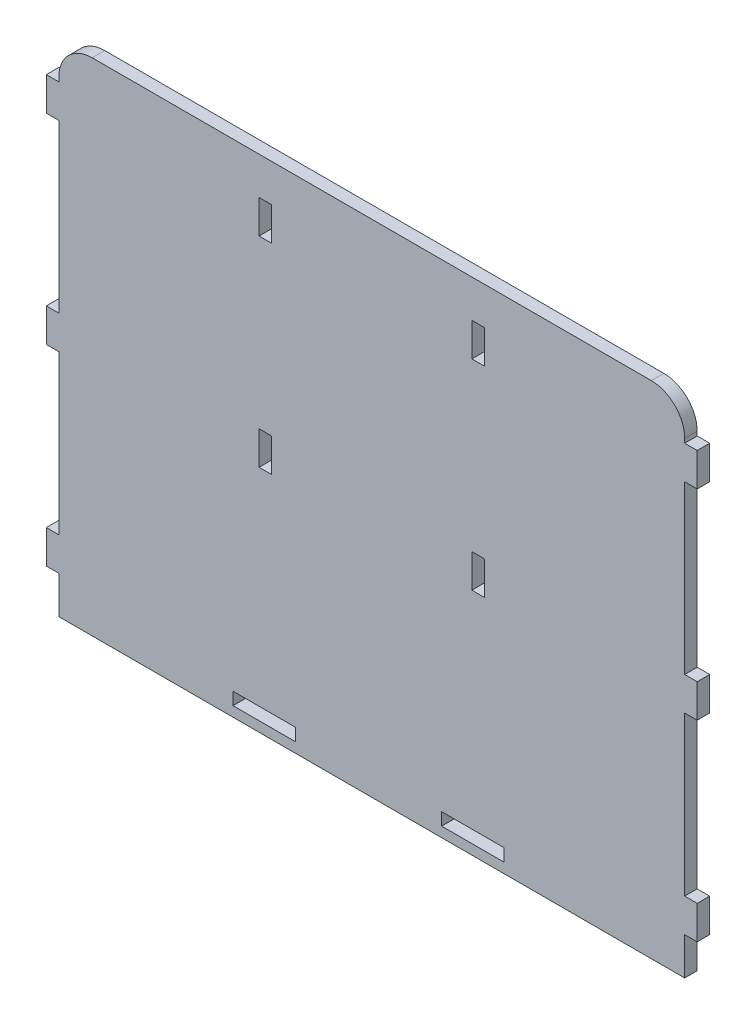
ISO-10303-21;
HEADER;
FILE_DESCRIPTION(('STEP AP214'),'2;1');
FILE_NAME('part.step','',(''),(''),'','','');
FILE_SCHEMA(('AUTOMOTIVE_DESIGN { 1 0 10303 214 1 1 1 1 }'));
ENDSEC;
DATA;
#1=APPLICATION_CONTEXT('core data for automotive mechanical design processes');
#2=APPLICATION_PROTOCOL_DEFINITION('international standard','automotive_design',2000,#1);
#3=PRODUCT_CONTEXT('',#1,'mechanical');
#4=PRODUCT('Part','Part','',(#3));
#5=PRODUCT_RELATED_PRODUCT_CATEGORY('part','',(#4));
#6=PRODUCT_DEFINITION_FORMATION('','',#4);
#7=PRODUCT_DEFINITION_CONTEXT('part definition',#1,'design');
#8=PRODUCT_DEFINITION('design','',#6,#7);
#9=PRODUCT_DEFINITION_SHAPE('','',#8);
#10=(LENGTH_UNIT() NAMED_UNIT(*) SI_UNIT(.MILLI.,.METRE.));
#11=(NAMED_UNIT(*) PLANE_ANGLE_UNIT() SI_UNIT($,.RADIAN.));
#12=(NAMED_UNIT(*) SI_UNIT($,.STERADIAN.) SOLID_ANGLE_UNIT());
#13=UNCERTAINTY_MEASURE_WITH_UNIT(LENGTH_MEASURE(1.E-05),#10,'distance_accuracy_value','');
#14=(GEOMETRIC_REPRESENTATION_CONTEXT(3) GLOBAL_UNCERTAINTY_ASSIGNED_CONTEXT((#13)) GLOBAL_UNIT_ASSIGNED_CONTEXT((#10,
#11,#12)) REPRESENTATION_CONTEXT('',''));
#15=CARTESIAN_POINT('',(0.,0.,0.));
#16=DIRECTION('',(0.,0.,1.));
#17=DIRECTION('',(1.,0.,0.));
#18=AXIS2_PLACEMENT_3D('',#15,#16,#17);
#19=CARTESIAN_POINT('',(-375.,0.,15.));
#20=DIRECTION('',(1.,0.,0.));
#21=DIRECTION('',(0.,1.,0.));
#22=AXIS2_PLACEMENT_3D('',#19,#20,#21);
#23=PLANE('',#22);
#24=DIRECTION('',(0.,-1.,0.));
#25=VECTOR('',#24,1.);
#26=CARTESIAN_POINT('',(-375.,0.,15.));
#27=LINE('',#26,#25);
#28=CARTESIAN_POINT('',(-375.,-40.,15.));
#29=VERTEX_POINT('',#28);
#30=CARTESIAN_POINT('',(-375.,-45.,15.));
#31=VERTEX_POINT('',#30);
#32=EDGE_CURVE('E575',#29,#31,#27,.T.);
#33=ORIENTED_EDGE('',*,*,#32,.F.);
#34=DIRECTION('',(0.,0.,-1.));
#35=VECTOR('',#34,1.);
#36=CARTESIAN_POINT('',(-375.,-40.,15.));
#37=LINE('',#36,#35);
#38=CARTESIAN_POINT('',(-375.,-40.,0.));
#39=VERTEX_POINT('',#38);
#40=EDGE_CURVE('E766',#29,#39,#37,.T.);
#41=ORIENTED_EDGE('',*,*,#40,.T.);
#42=DIRECTION('',(0.,-1.,0.));
#43=VECTOR('',#42,1.);
#44=CARTESIAN_POINT('',(-375.,0.,0.));
#45=LINE('',#44,#43);
#46=CARTESIAN_POINT('',(-375.,-45.,0.));
#47=VERTEX_POINT('',#46);
#48=EDGE_CURVE('E574',#39,#47,#45,.T.);
#49=ORIENTED_EDGE('',*,*,#48,.T.);
#50=DIRECTION('',(0.,0.,-1.));
#51=VECTOR('',#50,1.);
#52=CARTESIAN_POINT('',(-375.,-45.,15.));
#53=LINE('',#52,#51);
#54=EDGE_CURVE('E763',#31,#47,#53,.T.);
#55=ORIENTED_EDGE('',*,*,#54,.F.);
#56=EDGE_LOOP('',(#33,#41,#49,#55));
#57=FACE_BOUND('',#56,.T.);
#58=ADVANCED_FACE('F37',(#57),#23,.F.);
#59=CARTESIAN_POINT('',(-375.,-45.,15.));
#60=DIRECTION('',(0.,-1.,0.));
#61=DIRECTION('',(1.,0.,0.));
#62=AXIS2_PLACEMENT_3D('',#59,#60,#61);
#63=PLANE('',#62);
#64=DIRECTION('',(-1.,0.,0.));
#65=VECTOR('',#64,1.);
#66=CARTESIAN_POINT('',(-375.,-45.,0.));
#67=LINE('',#66,#65);
#68=CARTESIAN_POINT('',(-390.,-45.,0.));
#69=VERTEX_POINT('',#68);
#70=EDGE_CURVE('E635',#47,#69,#67,.T.);
#71=ORIENTED_EDGE('',*,*,#70,.T.);
#72=DIRECTION('',(0.,0.,-1.));
#73=VECTOR('',#72,1.);
#74=CARTESIAN_POINT('',(-390.,-45.,15.));
#75=LINE('',#74,#73);
#76=CARTESIAN_POINT('',(-390.,-45.,15.));
#77=VERTEX_POINT('',#76);
#78=EDGE_CURVE('E760',#77,#69,#75,.T.);
#79=ORIENTED_EDGE('',*,*,#78,.F.);
#80=DIRECTION('',(-1.,0.,0.));
#81=VECTOR('',#80,1.);
#82=CARTESIAN_POINT('',(-375.,-45.,15.));
#83=LINE('',#82,#81);
#84=EDGE_CURVE('E577',#31,#77,#83,.T.);
#85=ORIENTED_EDGE('',*,*,#84,.F.);
#86=ORIENTED_EDGE('',*,*,#54,.T.);
#87=EDGE_LOOP('',(#71,#79,#85,#86));
#88=FACE_BOUND('',#87,.T.);
#89=ADVANCED_FACE('F810',(#88),#63,.F.);
#90=CARTESIAN_POINT('',(-390.,-45.,15.));
#91=DIRECTION('',(1.,0.,0.));
#92=DIRECTION('',(0.,0.,-1.));
#93=AXIS2_PLACEMENT_3D('',#90,#91,#92);
#94=PLANE('',#93);
#95=DIRECTION('',(0.,-1.,0.));
#96=VECTOR('',#95,1.);
#97=CARTESIAN_POINT('',(-390.,-45.,0.));
#98=LINE('',#97,#96);
#99=CARTESIAN_POINT('',(-390.,-85.,0.));
#100=VERTEX_POINT('',#99);
#101=EDGE_CURVE('E637',#69,#100,#98,.T.);
#102=ORIENTED_EDGE('',*,*,#101,.T.);
#103=DIRECTION('',(0.,0.,-1.));
#104=VECTOR('',#103,1.);
#105=CARTESIAN_POINT('',(-390.,-85.,15.));
#106=LINE('',#105,#104);
#107=CARTESIAN_POINT('',(-390.,-85.,15.));
#108=VERTEX_POINT('',#107);
#109=EDGE_CURVE('E757',#108,#100,#106,.T.);
#110=ORIENTED_EDGE('',*,*,#109,.F.);
#111=DIRECTION('',(0.,-1.,0.));
#112=VECTOR('',#111,1.);
#113=CARTESIAN_POINT('',(-390.,-45.,15.));
#114=LINE('',#113,#112);
#115=EDGE_CURVE('E580',#77,#108,#114,.T.);
#116=ORIENTED_EDGE('',*,*,#115,.F.);
#117=ORIENTED_EDGE('',*,*,#78,.T.);
#118=EDGE_LOOP('',(#102,#110,#116,#117));
#119=FACE_BOUND('',#118,.T.);
#120=ADVANCED_FACE('F817',(#119),#94,.F.);
#121=CARTESIAN_POINT('',(-390.,-85.,15.));
#122=DIRECTION('',(0.,1.,0.));
#123=DIRECTION('',(0.,0.,1.));
#124=AXIS2_PLACEMENT_3D('',#121,#122,#123);
#125=PLANE('',#124);
#126=DIRECTION('',(1.,0.,0.));
#127=VECTOR('',#126,1.);
#128=CARTESIAN_POINT('',(-390.,-85.,0.));
#129=LINE('',#128,#127);
#130=CARTESIAN_POINT('',(-375.,-85.,0.));
#131=VERTEX_POINT('',#130);
#132=EDGE_CURVE('E639',#100,#131,#129,.T.);
#133=ORIENTED_EDGE('',*,*,#132,.T.);
#134=DIRECTION('',(0.,0.,-1.));
#135=VECTOR('',#134,1.);
#136=CARTESIAN_POINT('',(-375.,-85.,15.));
#137=LINE('',#136,#135);
#138=CARTESIAN_POINT('',(-375.,-85.,15.));
#139=VERTEX_POINT('',#138);
#140=EDGE_CURVE('E754',#139,#131,#137,.T.);
#141=ORIENTED_EDGE('',*,*,#140,.F.);
#142=DIRECTION('',(1.,0.,0.));
#143=VECTOR('',#142,1.);
#144=CARTESIAN_POINT('',(-390.,-85.,15.));
#145=LINE('',#144,#143);
#146=EDGE_CURVE('E582',#108,#139,#145,.T.);
#147=ORIENTED_EDGE('',*,*,#146,.F.);
#148=ORIENTED_EDGE('',*,*,#109,.T.);
#149=EDGE_LOOP('',(#133,#141,#147,#148));
#150=FACE_BOUND('',#149,.T.);
#151=ADVANCED_FACE('F821',(#150),#125,.F.);
#152=CARTESIAN_POINT('',(-375.,-85.,15.));
#153=DIRECTION('',(1.,0.,0.));
#154=DIRECTION('',(0.,0.,-1.));
#155=AXIS2_PLACEMENT_3D('',#152,#153,#154);
#156=PLANE('',#155);
#157=DIRECTION('',(0.,-1.,0.));
#158=VECTOR('',#157,1.);
#159=CARTESIAN_POINT('',(-375.,-85.,0.));
#160=LINE('',#159,#158);
#161=CARTESIAN_POINT('',(-375.,-285.,0.));
#162=VERTEX_POINT('',#161);
#163=EDGE_CURVE('E641',#131,#162,#160,.T.);
#164=ORIENTED_EDGE('',*,*,#163,.T.);
#165=DIRECTION('',(0.,0.,-1.));
#166=VECTOR('',#165,1.);
#167=CARTESIAN_POINT('',(-375.,-285.,15.));
#168=LINE('',#167,#166);
#169=CARTESIAN_POINT('',(-375.,-285.,15.));
#170=VERTEX_POINT('',#169);
#171=EDGE_CURVE('E751',#170,#162,#168,.T.);
#172=ORIENTED_EDGE('',*,*,#171,.F.);
#173=DIRECTION('',(0.,-1.,0.));
#174=VECTOR('',#173,1.);
#175=CARTESIAN_POINT('',(-375.,-85.,15.));
#176=LINE('',#175,#174);
#177=EDGE_CURVE('E584',#139,#170,#176,.T.);
#178=ORIENTED_EDGE('',*,*,#177,.F.);
#179=ORIENTED_EDGE('',*,*,#140,.T.);
#180=EDGE_LOOP('',(#164,#172,#178,#179));
#181=FACE_BOUND('',#180,.T.);
#182=ADVANCED_FACE('F826',(#181),#156,.F.);
#183=CARTESIAN_POINT('',(-375.,-285.,15.));
#184=DIRECTION('',(0.,-1.,0.));
#185=DIRECTION('',(0.,0.,-1.));
#186=AXIS2_PLACEMENT_3D('',#183,#184,#185);
#187=PLANE('',#186);
#188=DIRECTION('',(-1.,0.,0.));
#189=VECTOR('',#188,1.);
#190=CARTESIAN_POINT('',(-375.,-285.,0.));
#191=LINE('',#190,#189);
#192=CARTESIAN_POINT('',(-390.,-285.,0.));
#193=VERTEX_POINT('',#192);
#194=EDGE_CURVE('E643',#162,#193,#191,.T.);
#195=ORIENTED_EDGE('',*,*,#194,.T.);
#196=DIRECTION('',(0.,0.,-1.));
#197=VECTOR('',#196,1.);
#198=CARTESIAN_POINT('',(-390.,-285.,15.));
#199=LINE('',#198,#197);
#200=CARTESIAN_POINT('',(-390.,-285.,15.));
#201=VERTEX_POINT('',#200);
#202=EDGE_CURVE('E748',#201,#193,#199,.T.);
#203=ORIENTED_EDGE('',*,*,#202,.F.);
#204=DIRECTION('',(-1.,0.,0.));
#205=VECTOR('',#204,1.);
#206=CARTESIAN_POINT('',(-375.,-285.,15.));
#207=LINE('',#206,#205);
#208=EDGE_CURVE('E586',#170,#201,#207,.T.);
#209=ORIENTED_EDGE('',*,*,#208,.F.);
#210=ORIENTED_EDGE('',*,*,#171,.T.);
#211=EDGE_LOOP('',(#195,#203,#209,#210));
#212=FACE_BOUND('',#211,.T.);
#213=ADVANCED_FACE('F832',(#212),#187,.F.);
#214=CARTESIAN_POINT('',(-390.,-325.,15.));
#215=DIRECTION('',(1.,0.,0.));
#216=DIRECTION('',(0.,0.,-1.));
#217=AXIS2_PLACEMENT_3D('',#214,#215,#216);
#218=PLANE('',#217);
#219=DIRECTION('',(0.,-1.,0.));
#220=VECTOR('',#219,1.);
#221=CARTESIAN_POINT('',(-390.,-325.,0.));
#222=LINE('',#221,#220);
#223=CARTESIAN_POINT('',(-390.,-325.,0.));
#224=VERTEX_POINT('',#223);
#225=EDGE_CURVE('E645',#193,#224,#222,.T.);
#226=ORIENTED_EDGE('',*,*,#225,.T.);
#227=DIRECTION('',(0.,0.,-1.));
#228=VECTOR('',#227,1.);
#229=CARTESIAN_POINT('',(-390.,-325.,15.));
#230=LINE('',#229,#228);
#231=CARTESIAN_POINT('',(-390.,-325.,15.));
#232=VERTEX_POINT('',#231);
#233=EDGE_CURVE('E745',#232,#224,#230,.T.);
#234=ORIENTED_EDGE('',*,*,#233,.F.);
#235=DIRECTION('',(0.,-1.,0.));
#236=VECTOR('',#235,1.);
#237=CARTESIAN_POINT('',(-390.,-325.,15.));
#238=LINE('',#237,#236);
#239=EDGE_CURVE('E588',#201,#232,#238,.T.);
#240=ORIENTED_EDGE('',*,*,#239,.F.);
#241=ORIENTED_EDGE('',*,*,#202,.T.);
#242=EDGE_LOOP('',(#226,#234,#240,#241));
#243=FACE_BOUND('',#242,.T.);
#244=ADVANCED_FACE('F836',(#243),#218,.F.);
#245=CARTESIAN_POINT('',(-375.,-325.,15.));
#246=DIRECTION('',(0.,1.,0.));
#247=DIRECTION('',(0.,0.,1.));
#248=AXIS2_PLACEMENT_3D('',#245,#246,#247);
#249=PLANE('',#248);
#250=DIRECTION('',(1.,0.,0.));
#251=VECTOR('',#250,1.);
#252=CARTESIAN_POINT('',(-375.,-325.,0.));
#253=LINE('',#252,#251);
#254=CARTESIAN_POINT('',(-375.,-325.,0.));
#255=VERTEX_POINT('',#254);
#256=EDGE_CURVE('E647',#224,#255,#253,.T.);
#257=ORIENTED_EDGE('',*,*,#256,.T.);
#258=DIRECTION('',(0.,0.,-1.));
#259=VECTOR('',#258,1.);
#260=CARTESIAN_POINT('',(-375.,-325.,15.));
#261=LINE('',#260,#259);
#262=CARTESIAN_POINT('',(-375.,-325.,15.));
#263=VERTEX_POINT('',#262);
#264=EDGE_CURVE('E742',#263,#255,#261,.T.);
#265=ORIENTED_EDGE('',*,*,#264,.F.);
#266=DIRECTION('',(1.,0.,0.));
#267=VECTOR('',#266,1.);
#268=CARTESIAN_POINT('',(-375.,-325.,15.));
#269=LINE('',#268,#267);
#270=EDGE_CURVE('E590',#232,#263,#269,.T.);
#271=ORIENTED_EDGE('',*,*,#270,.F.);
#272=ORIENTED_EDGE('',*,*,#233,.T.);
#273=EDGE_LOOP('',(#257,#265,#271,#272));
#274=FACE_BOUND('',#273,.T.);
#275=ADVANCED_FACE('F841',(#274),#249,.F.);
#276=CARTESIAN_POINT('',(-375.,-325.,15.));
#277=DIRECTION('',(1.,0.,0.));
#278=DIRECTION('',(0.,1.,0.));
#279=AXIS2_PLACEMENT_3D('',#276,#277,#278);
#280=PLANE('',#279);
#281=DIRECTION('',(0.,-1.,0.));
#282=VECTOR('',#281,1.);
#283=CARTESIAN_POINT('',(-375.,-325.,0.));
#284=LINE('',#283,#282);
#285=CARTESIAN_POINT('',(-375.,-515.,0.));
#286=VERTEX_POINT('',#285);
#287=EDGE_CURVE('E649',#255,#286,#284,.T.);
#288=ORIENTED_EDGE('',*,*,#287,.T.);
#289=DIRECTION('',(0.,0.,-1.));
#290=VECTOR('',#289,1.);
#291=CARTESIAN_POINT('',(-375.,-515.,15.));
#292=LINE('',#291,#290);
#293=CARTESIAN_POINT('',(-375.,-515.,15.));
#294=VERTEX_POINT('',#293);
#295=EDGE_CURVE('E739',#294,#286,#292,.T.);
#296=ORIENTED_EDGE('',*,*,#295,.F.);
#297=DIRECTION('',(0.,-1.,0.));
#298=VECTOR('',#297,1.);
#299=CARTESIAN_POINT('',(-375.,-325.,15.));
#300=LINE('',#299,#298);
#301=EDGE_CURVE('E592',#263,#294,#300,.T.);
#302=ORIENTED_EDGE('',*,*,#301,.F.);
#303=ORIENTED_EDGE('',*,*,#264,.T.);
#304=EDGE_LOOP('',(#288,#296,#302,#303));
#305=FACE_BOUND('',#304,.T.);
#306=ADVANCED_FACE('F847',(#305),#280,.F.);
#307=CARTESIAN_POINT('',(-375.,-515.,15.));
#308=DIRECTION('',(0.,-1.,0.));
#309=DIRECTION('',(0.,0.,-1.));
#310=AXIS2_PLACEMENT_3D('',#307,#308,#309);
#311=PLANE('',#310);
#312=DIRECTION('',(-1.,0.,0.));
#313=VECTOR('',#312,1.);
#314=CARTESIAN_POINT('',(-375.,-515.,0.));
#315=LINE('',#314,#313);
#316=CARTESIAN_POINT('',(-390.,-515.,0.));
#317=VERTEX_POINT('',#316);
#318=EDGE_CURVE('E651',#286,#317,#315,.T.);
#319=ORIENTED_EDGE('',*,*,#318,.T.);
#320=DIRECTION('',(0.,0.,-1.));
#321=VECTOR('',#320,1.);
#322=CARTESIAN_POINT('',(-390.,-515.,15.));
#323=LINE('',#322,#321);
#324=CARTESIAN_POINT('',(-390.,-515.,15.));
#325=VERTEX_POINT('',#324);
#326=EDGE_CURVE('E736',#325,#317,#323,.T.);
#327=ORIENTED_EDGE('',*,*,#326,.F.);
#328=DIRECTION('',(-1.,0.,0.));
#329=VECTOR('',#328,1.);
#330=CARTESIAN_POINT('',(-375.,-515.,15.));
#331=LINE('',#330,#329);
#332=EDGE_CURVE('E594',#294,#325,#331,.T.);
#333=ORIENTED_EDGE('',*,*,#332,.F.);
#334=ORIENTED_EDGE('',*,*,#295,.T.);
#335=EDGE_LOOP('',(#319,#327,#333,#334));
#336=FACE_BOUND('',#335,.T.);
#337=ADVANCED_FACE('F851',(#336),#311,.F.);
#338=CARTESIAN_POINT('',(-390.,-515.,15.));
#339=DIRECTION('',(1.,0.,0.));
#340=DIRECTION('',(0.,0.,-1.));
#341=AXIS2_PLACEMENT_3D('',#338,#339,#340);
#342=PLANE('',#341);
#343=DIRECTION('',(0.,-1.,0.));
#344=VECTOR('',#343,1.);
#345=CARTESIAN_POINT('',(-390.,-515.,0.));
#346=LINE('',#345,#344);
#347=CARTESIAN_POINT('',(-390.,-555.,0.));
#348=VERTEX_POINT('',#347);
#349=EDGE_CURVE('E653',#317,#348,#346,.T.);
#350=ORIENTED_EDGE('',*,*,#349,.T.);
#351=DIRECTION('',(0.,0.,-1.));
#352=VECTOR('',#351,1.);
#353=CARTESIAN_POINT('',(-390.,-555.,15.));
#354=LINE('',#353,#352);
#355=CARTESIAN_POINT('',(-390.,-555.,15.));
#356=VERTEX_POINT('',#355);
#357=EDGE_CURVE('E733',#356,#348,#354,.T.);
#358=ORIENTED_EDGE('',*,*,#357,.F.);
#359=DIRECTION('',(0.,-1.,0.));
#360=VECTOR('',#359,1.);
#361=CARTESIAN_POINT('',(-390.,-515.,15.));
#362=LINE('',#361,#360);
#363=EDGE_CURVE('E596',#325,#356,#362,.T.);
#364=ORIENTED_EDGE('',*,*,#363,.F.);
#365=ORIENTED_EDGE('',*,*,#326,.T.);
#366=EDGE_LOOP('',(#350,#358,#364,#365));
#367=FACE_BOUND('',#366,.T.);
#368=ADVANCED_FACE('F856',(#367),#342,.F.);
#369=CARTESIAN_POINT('',(-390.,-555.,15.));
#370=DIRECTION('',(0.,1.,0.));
#371=DIRECTION('',(0.,0.,1.));
#372=AXIS2_PLACEMENT_3D('',#369,#370,#371);
#373=PLANE('',#372);
#374=DIRECTION('',(1.,0.,0.));
#375=VECTOR('',#374,1.);
#376=CARTESIAN_POINT('',(-390.,-555.,0.));
#377=LINE('',#376,#375);
#378=CARTESIAN_POINT('',(-375.,-555.,0.));
#379=VERTEX_POINT('',#378);
#380=EDGE_CURVE('E655',#348,#379,#377,.T.);
#381=ORIENTED_EDGE('',*,*,#380,.T.);
#382=DIRECTION('',(0.,0.,-1.));
#383=VECTOR('',#382,1.);
#384=CARTESIAN_POINT('',(-375.,-555.,15.));
#385=LINE('',#384,#383);
#386=CARTESIAN_POINT('',(-375.,-555.,15.));
#387=VERTEX_POINT('',#386);
#388=EDGE_CURVE('E730',#387,#379,#385,.T.);
#389=ORIENTED_EDGE('',*,*,#388,.F.);
#390=DIRECTION('',(1.,0.,0.));
#391=VECTOR('',#390,1.);
#392=CARTESIAN_POINT('',(-390.,-555.,15.));
#393=LINE('',#392,#391);
#394=EDGE_CURVE('E598',#356,#387,#393,.T.);
#395=ORIENTED_EDGE('',*,*,#394,.F.);
#396=ORIENTED_EDGE('',*,*,#357,.T.);
#397=EDGE_LOOP('',(#381,#389,#395,#396));
#398=FACE_BOUND('',#397,.T.);
#399=ADVANCED_FACE('F862',(#398),#373,.F.);
#400=CARTESIAN_POINT('',(-375.,-555.,15.));
#401=DIRECTION('',(1.,0.,0.));
#402=DIRECTION('',(0.,1.,0.));
#403=AXIS2_PLACEMENT_3D('',#400,#401,#402);
#404=PLANE('',#403);
#405=DIRECTION('',(0.,-1.,0.));
#406=VECTOR('',#405,1.);
#407=CARTESIAN_POINT('',(-375.,-555.,0.));
#408=LINE('',#407,#406);
#409=CARTESIAN_POINT('',(-375.,-600.,0.));
#410=VERTEX_POINT('',#409);
#411=EDGE_CURVE('E657',#379,#410,#408,.T.);
#412=ORIENTED_EDGE('',*,*,#411,.T.);
#413=DIRECTION('',(0.,0.,-1.));
#414=VECTOR('',#413,1.);
#415=CARTESIAN_POINT('',(-375.,-600.,15.));
#416=LINE('',#415,#414);
#417=CARTESIAN_POINT('',(-375.,-600.,15.));
#418=VERTEX_POINT('',#417);
#419=EDGE_CURVE('E727',#418,#410,#416,.T.);
#420=ORIENTED_EDGE('',*,*,#419,.F.);
#421=DIRECTION('',(0.,-1.,0.));
#422=VECTOR('',#421,1.);
#423=CARTESIAN_POINT('',(-375.,-555.,15.));
#424=LINE('',#423,#422);
#425=EDGE_CURVE('E600',#387,#418,#424,.T.);
#426=ORIENTED_EDGE('',*,*,#425,.F.);
#427=ORIENTED_EDGE('',*,*,#388,.T.);
#428=EDGE_LOOP('',(#412,#420,#426,#427));
#429=FACE_BOUND('',#428,.T.);
#430=ADVANCED_FACE('F866',(#429),#404,.F.);
#431=CARTESIAN_POINT('',(-375.,-600.,15.));
#432=DIRECTION('',(0.,1.,0.));
#433=DIRECTION('',(-1.,0.,0.));
#434=AXIS2_PLACEMENT_3D('',#431,#432,#433);
#435=PLANE('',#434);
#436=DIRECTION('',(1.,0.,0.));
#437=VECTOR('',#436,1.);
#438=CARTESIAN_POINT('',(-375.,-600.,0.));
#439=LINE('',#438,#437);
#440=CARTESIAN_POINT('',(375.,-600.,0.));
#441=VERTEX_POINT('',#440);
#442=EDGE_CURVE('E659',#410,#441,#439,.T.);
#443=ORIENTED_EDGE('',*,*,#442,.T.);
#444=DIRECTION('',(0.,0.,-1.));
#445=VECTOR('',#444,1.);
#446=CARTESIAN_POINT('',(375.,-600.,15.));
#447=LINE('',#446,#445);
#448=CARTESIAN_POINT('',(375.,-600.,15.));
#449=VERTEX_POINT('',#448);
#450=EDGE_CURVE('E724',#449,#441,#447,.T.);
#451=ORIENTED_EDGE('',*,*,#450,.F.);
#452=DIRECTION('',(1.,0.,0.));
#453=VECTOR('',#452,1.);
#454=CARTESIAN_POINT('',(-375.,-600.,15.));
#455=LINE('',#454,#453);
#456=EDGE_CURVE('E602',#418,#449,#455,.T.);
#457=ORIENTED_EDGE('',*,*,#456,.F.);
#458=ORIENTED_EDGE('',*,*,#419,.T.);
#459=EDGE_LOOP('',(#443,#451,#457,#458));
#460=FACE_BOUND('',#459,.T.);
#461=ADVANCED_FACE('F871',(#460),#435,.F.);
#462=CARTESIAN_POINT('',(375.,-555.,15.));
#463=DIRECTION('',(-1.,0.,0.));
#464=DIRECTION('',(0.,-1.,0.));
#465=AXIS2_PLACEMENT_3D('',#462,#463,#464);
#466=PLANE('',#465);
#467=DIRECTION('',(0.,1.,0.));
#468=VECTOR('',#467,1.);
#469=CARTESIAN_POINT('',(375.,-555.,0.));
#470=LINE('',#469,#468);
#471=CARTESIAN_POINT('',(375.,-555.,0.));
#472=VERTEX_POINT('',#471);
#473=EDGE_CURVE('E661',#441,#472,#470,.T.);
#474=ORIENTED_EDGE('',*,*,#473,.T.);
#475=DIRECTION('',(0.,0.,-1.));
#476=VECTOR('',#475,1.);
#477=CARTESIAN_POINT('',(375.,-555.,15.));
#478=LINE('',#477,#476);
#479=CARTESIAN_POINT('',(375.,-555.,15.));
#480=VERTEX_POINT('',#479);
#481=EDGE_CURVE('E721',#480,#472,#478,.T.);
#482=ORIENTED_EDGE('',*,*,#481,.F.);
#483=DIRECTION('',(0.,1.,0.));
#484=VECTOR('',#483,1.);
#485=CARTESIAN_POINT('',(375.,-555.,15.));
#486=LINE('',#485,#484);
#487=EDGE_CURVE('E604',#449,#480,#486,.T.);
#488=ORIENTED_EDGE('',*,*,#487,.F.);
#489=ORIENTED_EDGE('',*,*,#450,.T.);
#490=EDGE_LOOP('',(#474,#482,#488,#489));
#491=FACE_BOUND('',#490,.T.);
#492=ADVANCED_FACE('F877',(#491),#466,.F.);
#493=CARTESIAN_POINT('',(390.000000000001,-555.,15.));
#494=DIRECTION('',(0.,1.,0.));
#495=DIRECTION('',(0.,0.,1.));
#496=AXIS2_PLACEMENT_3D('',#493,#494,#495);
#497=PLANE('',#496);
#498=DIRECTION('',(1.,0.,0.));
#499=VECTOR('',#498,1.);
#500=CARTESIAN_POINT('',(390.000000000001,-555.,0.));
#501=LINE('',#500,#499);
#502=CARTESIAN_POINT('',(390.000000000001,-555.,0.));
#503=VERTEX_POINT('',#502);
#504=EDGE_CURVE('E663',#472,#503,#501,.T.);
#505=ORIENTED_EDGE('',*,*,#504,.T.);
#506=DIRECTION('',(0.,0.,-1.));
#507=VECTOR('',#506,1.);
#508=CARTESIAN_POINT('',(390.000000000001,-555.,15.));
#509=LINE('',#508,#507);
#510=CARTESIAN_POINT('',(390.000000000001,-555.,15.));
#511=VERTEX_POINT('',#510);
#512=EDGE_CURVE('E718',#511,#503,#509,.T.);
#513=ORIENTED_EDGE('',*,*,#512,.F.);
#514=DIRECTION('',(1.,0.,0.));
#515=VECTOR('',#514,1.);
#516=CARTESIAN_POINT('',(390.000000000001,-555.,15.));
#517=LINE('',#516,#515);
#518=EDGE_CURVE('E606',#480,#511,#517,.T.);
#519=ORIENTED_EDGE('',*,*,#518,.F.);
#520=ORIENTED_EDGE('',*,*,#481,.T.);
#521=EDGE_LOOP('',(#505,#513,#519,#520));
#522=FACE_BOUND('',#521,.T.);
#523=ADVANCED_FACE('F881',(#522),#497,.F.);
#524=CARTESIAN_POINT('',(390.000000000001,-515.,15.));
#525=DIRECTION('',(-1.,0.,0.));
#526=DIRECTION('',(0.,0.,1.));
#527=AXIS2_PLACEMENT_3D('',#524,#525,#526);
#528=PLANE('',#527);
#529=DIRECTION('',(0.,1.,0.));
#530=VECTOR('',#529,1.);
#531=CARTESIAN_POINT('',(390.000000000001,-515.,0.));
#532=LINE('',#531,#530);
#533=CARTESIAN_POINT('',(390.000000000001,-515.,0.));
#534=VERTEX_POINT('',#533);
#535=EDGE_CURVE('E665',#503,#534,#532,.T.);
#536=ORIENTED_EDGE('',*,*,#535,.T.);
#537=DIRECTION('',(0.,0.,-1.));
#538=VECTOR('',#537,1.);
#539=CARTESIAN_POINT('',(390.000000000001,-515.,15.));
#540=LINE('',#539,#538);
#541=CARTESIAN_POINT('',(390.000000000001,-515.,15.));
#542=VERTEX_POINT('',#541);
#543=EDGE_CURVE('E715',#542,#534,#540,.T.);
#544=ORIENTED_EDGE('',*,*,#543,.F.);
#545=DIRECTION('',(0.,1.,0.));
#546=VECTOR('',#545,1.);
#547=CARTESIAN_POINT('',(390.000000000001,-515.,15.));
#548=LINE('',#547,#546);
#549=EDGE_CURVE('E608',#511,#542,#548,.T.);
#550=ORIENTED_EDGE('',*,*,#549,.F.);
#551=ORIENTED_EDGE('',*,*,#512,.T.);
#552=EDGE_LOOP('',(#536,#544,#550,#551));
#553=FACE_BOUND('',#552,.T.);
#554=ADVANCED_FACE('F886',(#553),#528,.F.);
#555=CARTESIAN_POINT('',(375.,-515.,15.));
#556=DIRECTION('',(0.,-1.,0.));
#557=DIRECTION('',(0.,0.,-1.));
#558=AXIS2_PLACEMENT_3D('',#555,#556,#557);
#559=PLANE('',#558);
#560=DIRECTION('',(-1.,0.,0.));
#561=VECTOR('',#560,1.);
#562=CARTESIAN_POINT('',(375.,-515.,0.));
#563=LINE('',#562,#561);
#564=CARTESIAN_POINT('',(375.,-515.,0.));
#565=VERTEX_POINT('',#564);
#566=EDGE_CURVE('E667',#534,#565,#563,.T.);
#567=ORIENTED_EDGE('',*,*,#566,.T.);
#568=DIRECTION('',(0.,0.,-1.));
#569=VECTOR('',#568,1.);
#570=CARTESIAN_POINT('',(375.,-515.,15.));
#571=LINE('',#570,#569);
#572=CARTESIAN_POINT('',(375.,-515.,15.));
#573=VERTEX_POINT('',#572);
#574=EDGE_CURVE('E712',#573,#565,#571,.T.);
#575=ORIENTED_EDGE('',*,*,#574,.F.);
#576=DIRECTION('',(-1.,0.,0.));
#577=VECTOR('',#576,1.);
#578=CARTESIAN_POINT('',(375.,-515.,15.));
#579=LINE('',#578,#577);
#580=EDGE_CURVE('E610',#542,#573,#579,.T.);
#581=ORIENTED_EDGE('',*,*,#580,.F.);
#582=ORIENTED_EDGE('',*,*,#543,.T.);
#583=EDGE_LOOP('',(#567,#575,#581,#582));
#584=FACE_BOUND('',#583,.T.);
#585=ADVANCED_FACE('F892',(#584),#559,.F.);
#586=CARTESIAN_POINT('',(375.,-325.,15.));
#587=DIRECTION('',(-1.,0.,0.));
#588=DIRECTION('',(0.,-1.,0.));
#589=AXIS2_PLACEMENT_3D('',#586,#587,#588);
#590=PLANE('',#589);
#591=DIRECTION('',(0.,1.,0.));
#592=VECTOR('',#591,1.);
#593=CARTESIAN_POINT('',(375.,-325.,0.));
#594=LINE('',#593,#592);
#595=CARTESIAN_POINT('',(375.,-325.,0.));
#596=VERTEX_POINT('',#595);
#597=EDGE_CURVE('E669',#565,#596,#594,.T.);
#598=ORIENTED_EDGE('',*,*,#597,.T.);
#599=DIRECTION('',(0.,0.,-1.));
#600=VECTOR('',#599,1.);
#601=CARTESIAN_POINT('',(375.,-325.,15.));
#602=LINE('',#601,#600);
#603=CARTESIAN_POINT('',(375.,-325.,15.));
#604=VERTEX_POINT('',#603);
#605=EDGE_CURVE('E709',#604,#596,#602,.T.);
#606=ORIENTED_EDGE('',*,*,#605,.F.);
#607=DIRECTION('',(0.,1.,0.));
#608=VECTOR('',#607,1.);
#609=CARTESIAN_POINT('',(375.,-325.,15.));
#610=LINE('',#609,#608);
#611=EDGE_CURVE('E612',#573,#604,#610,.T.);
#612=ORIENTED_EDGE('',*,*,#611,.F.);
#613=ORIENTED_EDGE('',*,*,#574,.T.);
#614=EDGE_LOOP('',(#598,#606,#612,#613));
#615=FACE_BOUND('',#614,.T.);
#616=ADVANCED_FACE('F896',(#615),#590,.F.);
#617=CARTESIAN_POINT('',(375.,-325.,15.));
#618=DIRECTION('',(0.,1.,0.));
#619=DIRECTION('',(0.,0.,1.));
#620=AXIS2_PLACEMENT_3D('',#617,#618,#619);
#621=PLANE('',#620);
#622=DIRECTION('',(1.,0.,0.));
#623=VECTOR('',#622,1.);
#624=CARTESIAN_POINT('',(375.,-325.,0.));
#625=LINE('',#624,#623);
#626=CARTESIAN_POINT('',(390.,-325.,0.));
#627=VERTEX_POINT('',#626);
#628=EDGE_CURVE('E671',#596,#627,#625,.T.);
#629=ORIENTED_EDGE('',*,*,#628,.T.);
#630=DIRECTION('',(0.,0.,-1.));
#631=VECTOR('',#630,1.);
#632=CARTESIAN_POINT('',(390.,-325.,15.));
#633=LINE('',#632,#631);
#634=CARTESIAN_POINT('',(390.,-325.,15.));
#635=VERTEX_POINT('',#634);
#636=EDGE_CURVE('E706',#635,#627,#633,.T.);
#637=ORIENTED_EDGE('',*,*,#636,.F.);
#638=DIRECTION('',(1.,0.,0.));
#639=VECTOR('',#638,1.);
#640=CARTESIAN_POINT('',(375.,-325.,15.));
#641=LINE('',#640,#639);
#642=EDGE_CURVE('E614',#604,#635,#641,.T.);
#643=ORIENTED_EDGE('',*,*,#642,.F.);
#644=ORIENTED_EDGE('',*,*,#605,.T.);
#645=EDGE_LOOP('',(#629,#637,#643,#644));
#646=FACE_BOUND('',#645,.T.);
#647=ADVANCED_FACE('F901',(#646),#621,.F.);
#648=CARTESIAN_POINT('',(390.,-325.,15.));
#649=DIRECTION('',(-1.,0.,0.));
#650=DIRECTION('',(0.,0.,1.));
#651=AXIS2_PLACEMENT_3D('',#648,#649,#650);
#652=PLANE('',#651);
#653=DIRECTION('',(0.,1.,0.));
#654=VECTOR('',#653,1.);
#655=CARTESIAN_POINT('',(390.,-325.,0.));
#656=LINE('',#655,#654);
#657=CARTESIAN_POINT('',(390.,-285.,0.));
#658=VERTEX_POINT('',#657);
#659=EDGE_CURVE('E673',#627,#658,#656,.T.);
#660=ORIENTED_EDGE('',*,*,#659,.T.);
#661=DIRECTION('',(0.,0.,-1.));
#662=VECTOR('',#661,1.);
#663=CARTESIAN_POINT('',(390.,-285.,15.));
#664=LINE('',#663,#662);
#665=CARTESIAN_POINT('',(390.,-285.,15.));
#666=VERTEX_POINT('',#665);
#667=EDGE_CURVE('E703',#666,#658,#664,.T.);
#668=ORIENTED_EDGE('',*,*,#667,.F.);
#669=DIRECTION('',(0.,1.,0.));
#670=VECTOR('',#669,1.);
#671=CARTESIAN_POINT('',(390.,-325.,15.));
#672=LINE('',#671,#670);
#673=EDGE_CURVE('E616',#635,#666,#672,.T.);
#674=ORIENTED_EDGE('',*,*,#673,.F.);
#675=ORIENTED_EDGE('',*,*,#636,.T.);
#676=EDGE_LOOP('',(#660,#668,#674,#675));
#677=FACE_BOUND('',#676,.T.);
#678=ADVANCED_FACE('F907',(#677),#652,.F.);
#679=CARTESIAN_POINT('',(375.,-285.,15.));
#680=DIRECTION('',(0.,-1.,0.));
#681=DIRECTION('',(0.,0.,-1.));
#682=AXIS2_PLACEMENT_3D('',#679,#680,#681);
#683=PLANE('',#682);
#684=DIRECTION('',(-1.,0.,0.));
#685=VECTOR('',#684,1.);
#686=CARTESIAN_POINT('',(375.,-285.,0.));
#687=LINE('',#686,#685);
#688=CARTESIAN_POINT('',(375.,-285.,0.));
#689=VERTEX_POINT('',#688);
#690=EDGE_CURVE('E675',#658,#689,#687,.T.);
#691=ORIENTED_EDGE('',*,*,#690,.T.);
#692=DIRECTION('',(0.,0.,-1.));
#693=VECTOR('',#692,1.);
#694=CARTESIAN_POINT('',(375.,-285.,15.));
#695=LINE('',#694,#693);
#696=CARTESIAN_POINT('',(375.,-285.,15.));
#697=VERTEX_POINT('',#696);
#698=EDGE_CURVE('E700',#697,#689,#695,.T.);
#699=ORIENTED_EDGE('',*,*,#698,.F.);
#700=DIRECTION('',(-1.,0.,0.));
#701=VECTOR('',#700,1.);
#702=CARTESIAN_POINT('',(375.,-285.,15.));
#703=LINE('',#702,#701);
#704=EDGE_CURVE('E618',#666,#697,#703,.T.);
#705=ORIENTED_EDGE('',*,*,#704,.F.);
#706=ORIENTED_EDGE('',*,*,#667,.T.);
#707=EDGE_LOOP('',(#691,#699,#705,#706));
#708=FACE_BOUND('',#707,.T.);
#709=ADVANCED_FACE('F911',(#708),#683,.F.);
#710=CARTESIAN_POINT('',(375.,-84.9999999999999,15.));
#711=DIRECTION('',(-1.,0.,0.));
#712=DIRECTION('',(0.,-1.,0.));
#713=AXIS2_PLACEMENT_3D('',#710,#711,#712);
#714=PLANE('',#713);
#715=DIRECTION('',(0.,1.,0.));
#716=VECTOR('',#715,1.);
#717=CARTESIAN_POINT('',(375.,-84.9999999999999,0.));
#718=LINE('',#717,#716);
#719=CARTESIAN_POINT('',(375.,-84.9999999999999,0.));
#720=VERTEX_POINT('',#719);
#721=EDGE_CURVE('E677',#689,#720,#718,.T.);
#722=ORIENTED_EDGE('',*,*,#721,.T.);
#723=DIRECTION('',(0.,0.,-1.));
#724=VECTOR('',#723,1.);
#725=CARTESIAN_POINT('',(375.,-84.9999999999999,15.));
#726=LINE('',#725,#724);
#727=CARTESIAN_POINT('',(375.,-84.9999999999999,15.));
#728=VERTEX_POINT('',#727);
#729=EDGE_CURVE('E697',#728,#720,#726,.T.);
#730=ORIENTED_EDGE('',*,*,#729,.F.);
#731=DIRECTION('',(0.,1.,0.));
#732=VECTOR('',#731,1.);
#733=CARTESIAN_POINT('',(375.,-84.9999999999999,15.));
#734=LINE('',#733,#732);
#735=EDGE_CURVE('E620',#697,#728,#734,.T.);
#736=ORIENTED_EDGE('',*,*,#735,.F.);
#737=ORIENTED_EDGE('',*,*,#698,.T.);
#738=EDGE_LOOP('',(#722,#730,#736,#737));
#739=FACE_BOUND('',#738,.T.);
#740=ADVANCED_FACE('F916',(#739),#714,.F.);
#741=CARTESIAN_POINT('',(390.,-84.9999999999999,15.));
#742=DIRECTION('',(0.,1.,0.));
#743=DIRECTION('',(0.,0.,1.));
#744=AXIS2_PLACEMENT_3D('',#741,#742,#743);
#745=PLANE('',#744);
#746=DIRECTION('',(1.,0.,0.));
#747=VECTOR('',#746,1.);
#748=CARTESIAN_POINT('',(390.,-84.9999999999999,0.));
#749=LINE('',#748,#747);
#750=CARTESIAN_POINT('',(390.,-84.9999999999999,0.));
#751=VERTEX_POINT('',#750);
#752=EDGE_CURVE('E679',#720,#751,#749,.T.);
#753=ORIENTED_EDGE('',*,*,#752,.T.);
#754=DIRECTION('',(0.,0.,-1.));
#755=VECTOR('',#754,1.);
#756=CARTESIAN_POINT('',(390.,-84.9999999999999,15.));
#757=LINE('',#756,#755);
#758=CARTESIAN_POINT('',(390.,-84.9999999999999,15.));
#759=VERTEX_POINT('',#758);
#760=EDGE_CURVE('E694',#759,#751,#757,.T.);
#761=ORIENTED_EDGE('',*,*,#760,.F.);
#762=DIRECTION('',(1.,0.,0.));
#763=VECTOR('',#762,1.);
#764=CARTESIAN_POINT('',(390.,-84.9999999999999,15.));
#765=LINE('',#764,#763);
#766=EDGE_CURVE('E622',#728,#759,#765,.T.);
#767=ORIENTED_EDGE('',*,*,#766,.F.);
#768=ORIENTED_EDGE('',*,*,#729,.T.);
#769=EDGE_LOOP('',(#753,#761,#767,#768));
#770=FACE_BOUND('',#769,.T.);
#771=ADVANCED_FACE('F922',(#770),#745,.F.);
#772=CARTESIAN_POINT('',(390.,-44.9999999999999,15.));
#773=DIRECTION('',(-1.,0.,0.));
#774=DIRECTION('',(0.,0.,1.));
#775=AXIS2_PLACEMENT_3D('',#772,#773,#774);
#776=PLANE('',#775);
#777=DIRECTION('',(0.,1.,0.));
#778=VECTOR('',#777,1.);
#779=CARTESIAN_POINT('',(390.,-44.9999999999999,0.));
#780=LINE('',#779,#778);
#781=CARTESIAN_POINT('',(390.,-44.9999999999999,0.));
#782=VERTEX_POINT('',#781);
#783=EDGE_CURVE('E681',#751,#782,#780,.T.);
#784=ORIENTED_EDGE('',*,*,#783,.T.);
#785=DIRECTION('',(0.,0.,-1.));
#786=VECTOR('',#785,1.);
#787=CARTESIAN_POINT('',(390.,-44.9999999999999,15.));
#788=LINE('',#787,#786);
#789=CARTESIAN_POINT('',(390.,-44.9999999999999,15.));
#790=VERTEX_POINT('',#789);
#791=EDGE_CURVE('E691',#790,#782,#788,.T.);
#792=ORIENTED_EDGE('',*,*,#791,.F.);
#793=DIRECTION('',(0.,1.,0.));
#794=VECTOR('',#793,1.);
#795=CARTESIAN_POINT('',(390.,-44.9999999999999,15.));
#796=LINE('',#795,#794);
#797=EDGE_CURVE('E624',#759,#790,#796,.T.);
#798=ORIENTED_EDGE('',*,*,#797,.F.);
#799=ORIENTED_EDGE('',*,*,#760,.T.);
#800=EDGE_LOOP('',(#784,#792,#798,#799));
#801=FACE_BOUND('',#800,.T.);
#802=ADVANCED_FACE('F926',(#801),#776,.F.);
#803=CARTESIAN_POINT('',(375.,-44.9999999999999,15.));
#804=DIRECTION('',(0.,-1.,0.));
#805=DIRECTION('',(1.,0.,0.));
#806=AXIS2_PLACEMENT_3D('',#803,#804,#805);
#807=PLANE('',#806);
#808=DIRECTION('',(-1.,0.,0.));
#809=VECTOR('',#808,1.);
#810=CARTESIAN_POINT('',(375.,-44.9999999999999,0.));
#811=LINE('',#810,#809);
#812=CARTESIAN_POINT('',(375.,-44.9999999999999,0.));
#813=VERTEX_POINT('',#812);
#814=EDGE_CURVE('E683',#782,#813,#811,.T.);
#815=ORIENTED_EDGE('',*,*,#814,.T.);
#816=DIRECTION('',(0.,0.,-1.));
#817=VECTOR('',#816,1.);
#818=CARTESIAN_POINT('',(375.,-44.9999999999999,15.));
#819=LINE('',#818,#817);
#820=CARTESIAN_POINT('',(375.,-44.9999999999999,15.));
#821=VERTEX_POINT('',#820);
#822=EDGE_CURVE('E633',#821,#813,#819,.T.);
#823=ORIENTED_EDGE('',*,*,#822,.F.);
#824=DIRECTION('',(-1.,0.,0.));
#825=VECTOR('',#824,1.);
#826=CARTESIAN_POINT('',(375.,-44.9999999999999,15.));
#827=LINE('',#826,#825);
#828=EDGE_CURVE('E626',#790,#821,#827,.T.);
#829=ORIENTED_EDGE('',*,*,#828,.F.);
#830=ORIENTED_EDGE('',*,*,#791,.T.);
#831=EDGE_LOOP('',(#815,#823,#829,#830));
#832=FACE_BOUND('',#831,.T.);
#833=ADVANCED_FACE('F929',(#832),#807,.F.);
#834=CARTESIAN_POINT('',(375.,1.11022302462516E-13,15.));
#835=DIRECTION('',(-1.,0.,0.));
#836=DIRECTION('',(0.,-1.,0.));
#837=AXIS2_PLACEMENT_3D('',#834,#835,#836);
#838=PLANE('',#837);
#839=DIRECTION('',(0.,1.,0.));
#840=VECTOR('',#839,1.);
#841=CARTESIAN_POINT('',(375.,1.11022302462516E-13,0.));
#842=LINE('',#841,#840);
#843=CARTESIAN_POINT('',(375.,-39.9999999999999,0.));
#844=VERTEX_POINT('',#843);
#845=EDGE_CURVE('E685',#813,#844,#842,.T.);
#846=ORIENTED_EDGE('',*,*,#845,.T.);
#847=DIRECTION('',(0.,0.,-1.));
#848=VECTOR('',#847,1.);
#849=CARTESIAN_POINT('',(375.,-39.9999999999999,15.));
#850=LINE('',#849,#848);
#851=CARTESIAN_POINT('',(375.,-39.9999999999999,15.));
#852=VERTEX_POINT('',#851);
#853=EDGE_CURVE('E45',#844,#852,#850,.F.);
#854=ORIENTED_EDGE('',*,*,#853,.T.);
#855=DIRECTION('',(0.,1.,0.));
#856=VECTOR('',#855,1.);
#857=CARTESIAN_POINT('',(375.,1.11022302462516E-13,15.));
#858=LINE('',#857,#856);
#859=EDGE_CURVE('E628',#821,#852,#858,.T.);
#860=ORIENTED_EDGE('',*,*,#859,.F.);
#861=ORIENTED_EDGE('',*,*,#822,.T.);
#862=EDGE_LOOP('',(#846,#854,#860,#861));
#863=FACE_BOUND('',#862,.T.);
#864=ADVANCED_FACE('F784',(#863),#838,.F.);
#865=CARTESIAN_POINT('',(-375.,0.,15.));
#866=DIRECTION('',(0.,-1.,0.));
#867=DIRECTION('',(1.,0.,0.));
#868=AXIS2_PLACEMENT_3D('',#865,#866,#867);
#869=PLANE('',#868);
#870=DIRECTION('',(-1.,0.,0.));
#871=VECTOR('',#870,1.);
#872=CARTESIAN_POINT('',(-375.,0.,15.));
#873=LINE('',#872,#871);
#874=CARTESIAN_POINT('',(335.,1.05101112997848E-13,15.));
#875=VERTEX_POINT('',#874);
#876=CARTESIAN_POINT('',(-335.,0.,15.));
#877=VERTEX_POINT('',#876);
#878=EDGE_CURVE('E631',#875,#877,#873,.T.);
#879=ORIENTED_EDGE('',*,*,#878,.F.);
#880=DIRECTION('',(0.,0.,-1.));
#881=VECTOR('',#880,1.);
#882=CARTESIAN_POINT('',(335.,1.05101112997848E-13,15.));
#883=LINE('',#882,#881);
#884=CARTESIAN_POINT('',(335.,1.05101112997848E-13,0.));
#885=VERTEX_POINT('',#884);
#886=EDGE_CURVE('E777',#875,#885,#883,.T.);
#887=ORIENTED_EDGE('',*,*,#886,.T.);
#888=DIRECTION('',(-1.,0.,0.));
#889=VECTOR('',#888,1.);
#890=CARTESIAN_POINT('',(-375.,0.,0.));
#891=LINE('',#890,#889);
#892=CARTESIAN_POINT('',(-335.,0.,0.));
#893=VERTEX_POINT('',#892);
#894=EDGE_CURVE('E578',#885,#893,#891,.T.);
#895=ORIENTED_EDGE('',*,*,#894,.T.);
#896=DIRECTION('',(0.,0.,-1.));
#897=VECTOR('',#896,1.);
#898=CARTESIAN_POINT('',(-335.,0.,15.));
#899=LINE('',#898,#897);
#900=EDGE_CURVE('E772',#893,#877,#899,.F.);
#901=ORIENTED_EDGE('',*,*,#900,.T.);
#902=EDGE_LOOP('',(#879,#887,#895,#901));
#903=FACE_BOUND('',#902,.T.);
#904=ADVANCED_FACE('F796',(#903),#869,.F.);
#905=CARTESIAN_POINT('',(0.,0.,15.));
#906=DIRECTION('',(0.,0.,-1.));
#907=DIRECTION('',(-1.,0.,0.));
#908=AXIS2_PLACEMENT_3D('',#905,#906,#907);
#909=PLANE('',#908);
#910=DIRECTION('',(1.,0.,0.));
#911=VECTOR('',#910,1.);
#912=CARTESIAN_POINT('',(-166.25,-588.,15.));
#913=LINE('',#912,#911);
#914=CARTESIAN_POINT('',(-166.25,-588.,15.));
#915=VERTEX_POINT('',#914);
#916=CARTESIAN_POINT('',(-91.2499999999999,-588.,15.));
#917=VERTEX_POINT('',#916);
#918=EDGE_CURVE('E401',#915,#917,#913,.T.);
#919=ORIENTED_EDGE('',*,*,#918,.F.);
#920=DIRECTION('',(0.,-1.,0.));
#921=VECTOR('',#920,1.);
#922=CARTESIAN_POINT('',(-166.25,-573.,15.));
#923=LINE('',#922,#921);
#924=CARTESIAN_POINT('',(-166.25,-573.,15.));
#925=VERTEX_POINT('',#924);
#926=EDGE_CURVE('E52',#925,#915,#923,.T.);
#927=ORIENTED_EDGE('',*,*,#926,.F.);
#928=DIRECTION('',(-1.,0.,0.));
#929=VECTOR('',#928,1.);
#930=CARTESIAN_POINT('',(-166.25,-573.,15.));
#931=LINE('',#930,#929);
#932=CARTESIAN_POINT('',(-91.25,-573.,15.));
#933=VERTEX_POINT('',#932);
#934=EDGE_CURVE('E394',#933,#925,#931,.T.);
#935=ORIENTED_EDGE('',*,*,#934,.F.);
#936=DIRECTION('',(0.,1.,0.));
#937=VECTOR('',#936,1.);
#938=CARTESIAN_POINT('',(-91.25,-573.,15.));
#939=LINE('',#938,#937);
#940=EDGE_CURVE('E408',#917,#933,#939,.T.);
#941=ORIENTED_EDGE('',*,*,#940,.F.);
#942=EDGE_LOOP('',(#919,#927,#935,#941));
#943=FACE_BOUND('',#942,.T.);
#944=DIRECTION('',(1.,0.,0.));
#945=VECTOR('',#944,1.);
#946=CARTESIAN_POINT('',(83.75,-588.,15.));
#947=LINE('',#946,#945);
#948=CARTESIAN_POINT('',(83.75,-588.,15.));
#949=VERTEX_POINT('',#948);
#950=CARTESIAN_POINT('',(158.75,-588.,15.));
#951=VERTEX_POINT('',#950);
#952=EDGE_CURVE('E434',#949,#951,#947,.T.);
#953=ORIENTED_EDGE('',*,*,#952,.F.);
#954=DIRECTION('',(0.,-1.,0.));
#955=VECTOR('',#954,1.);
#956=CARTESIAN_POINT('',(83.75,-573.,15.));
#957=LINE('',#956,#955);
#958=CARTESIAN_POINT('',(83.75,-573.,15.));
#959=VERTEX_POINT('',#958);
#960=EDGE_CURVE('E60',#959,#949,#957,.T.);
#961=ORIENTED_EDGE('',*,*,#960,.F.);
#962=DIRECTION('',(-1.,0.,0.));
#963=VECTOR('',#962,1.);
#964=CARTESIAN_POINT('',(83.75,-573.,15.));
#965=LINE('',#964,#963);
#966=CARTESIAN_POINT('',(158.75,-573.,15.));
#967=VERTEX_POINT('',#966);
#968=EDGE_CURVE('E423',#967,#959,#965,.T.);
#969=ORIENTED_EDGE('',*,*,#968,.F.);
#970=DIRECTION('',(0.,1.,0.));
#971=VECTOR('',#970,1.);
#972=CARTESIAN_POINT('',(158.75,-573.,15.));
#973=LINE('',#972,#971);
#974=EDGE_CURVE('E431',#951,#967,#973,.T.);
#975=ORIENTED_EDGE('',*,*,#974,.F.);
#976=EDGE_LOOP('',(#953,#961,#969,#975));
#977=FACE_BOUND('',#976,.T.);
#978=DIRECTION('',(1.,0.,0.));
#979=VECTOR('',#978,1.);
#980=CARTESIAN_POINT('',(120.,-325.,15.));
#981=LINE('',#980,#979);
#982=CARTESIAN_POINT('',(120.,-325.,15.));
#983=VERTEX_POINT('',#982);
#984=CARTESIAN_POINT('',(135.,-325.,15.));
#985=VERTEX_POINT('',#984);
#986=EDGE_CURVE('E530',#983,#985,#981,.T.);
#987=ORIENTED_EDGE('',*,*,#986,.F.);
#988=DIRECTION('',(0.,-1.,0.));
#989=VECTOR('',#988,1.);
#990=CARTESIAN_POINT('',(120.,-285.,15.));
#991=LINE('',#990,#989);
#992=CARTESIAN_POINT('',(120.,-285.,15.));
#993=VERTEX_POINT('',#992);
#994=EDGE_CURVE('E533',#993,#983,#991,.T.);
#995=ORIENTED_EDGE('',*,*,#994,.F.);
#996=DIRECTION('',(-1.,0.,0.));
#997=VECTOR('',#996,1.);
#998=CARTESIAN_POINT('',(120.,-285.,15.));
#999=LINE('',#998,#997);
#1000=CARTESIAN_POINT('',(135.,-285.,15.));
#1001=VERTEX_POINT('',#1000);
#1002=EDGE_CURVE('E519',#1001,#993,#999,.T.);
#1003=ORIENTED_EDGE('',*,*,#1002,.F.);
#1004=DIRECTION('',(0.,1.,0.));
#1005=VECTOR('',#1004,1.);
#1006=CARTESIAN_POINT('',(135.,-285.,15.));
#1007=LINE('',#1006,#1005);
#1008=EDGE_CURVE('E527',#985,#1001,#1007,.T.);
#1009=ORIENTED_EDGE('',*,*,#1008,.F.);
#1010=EDGE_LOOP('',(#987,#995,#1003,#1009));
#1011=FACE_BOUND('',#1010,.T.);
#1012=DIRECTION('',(1.,0.,0.));
#1013=VECTOR('',#1012,1.);
#1014=CARTESIAN_POINT('',(-135.,-325.,15.));
#1015=LINE('',#1014,#1013);
#1016=CARTESIAN_POINT('',(-135.,-325.,15.));
#1017=VERTEX_POINT('',#1016);
#1018=CARTESIAN_POINT('',(-120.,-325.,15.));
#1019=VERTEX_POINT('',#1018);
#1020=EDGE_CURVE('E500',#1017,#1019,#1015,.T.);
#1021=ORIENTED_EDGE('',*,*,#1020,.F.);
#1022=DIRECTION('',(0.,-1.,0.));
#1023=VECTOR('',#1022,1.);
#1024=CARTESIAN_POINT('',(-135.,-285.,15.));
#1025=LINE('',#1024,#1023);
#1026=CARTESIAN_POINT('',(-135.,-285.,15.));
#1027=VERTEX_POINT('',#1026);
#1028=EDGE_CURVE('E503',#1027,#1017,#1025,.T.);
#1029=ORIENTED_EDGE('',*,*,#1028,.F.);
#1030=DIRECTION('',(-1.,0.,0.));
#1031=VECTOR('',#1030,1.);
#1032=CARTESIAN_POINT('',(-135.,-285.,15.));
#1033=LINE('',#1032,#1031);
#1034=CARTESIAN_POINT('',(-120.,-285.,15.));
#1035=VERTEX_POINT('',#1034);
#1036=EDGE_CURVE('E489',#1035,#1027,#1033,.T.);
#1037=ORIENTED_EDGE('',*,*,#1036,.F.);
#1038=DIRECTION('',(0.,1.,0.));
#1039=VECTOR('',#1038,1.);
#1040=CARTESIAN_POINT('',(-120.,-285.,15.));
#1041=LINE('',#1040,#1039);
#1042=EDGE_CURVE('E497',#1019,#1035,#1041,.T.);
#1043=ORIENTED_EDGE('',*,*,#1042,.F.);
#1044=EDGE_LOOP('',(#1021,#1029,#1037,#1043));
#1045=FACE_BOUND('',#1044,.T.);
#1046=DIRECTION('',(1.,0.,0.));
#1047=VECTOR('',#1046,1.);
#1048=CARTESIAN_POINT('',(-135.,-84.9999999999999,15.));
#1049=LINE('',#1048,#1047);
#1050=CARTESIAN_POINT('',(-135.,-84.9999999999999,15.));
#1051=VERTEX_POINT('',#1050);
#1052=CARTESIAN_POINT('',(-120.,-84.9999999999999,15.));
#1053=VERTEX_POINT('',#1052);
#1054=EDGE_CURVE('E466',#1051,#1053,#1049,.T.);
#1055=ORIENTED_EDGE('',*,*,#1054,.F.);
#1056=DIRECTION('',(0.,-1.,0.));
#1057=VECTOR('',#1056,1.);
#1058=CARTESIAN_POINT('',(-135.,-44.9999999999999,15.));
#1059=LINE('',#1058,#1057);
#1060=CARTESIAN_POINT('',(-135.,-44.9999999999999,15.));
#1061=VERTEX_POINT('',#1060);
#1062=EDGE_CURVE('E469',#1061,#1051,#1059,.T.);
#1063=ORIENTED_EDGE('',*,*,#1062,.F.);
#1064=DIRECTION('',(-1.,0.,0.));
#1065=VECTOR('',#1064,1.);
#1066=CARTESIAN_POINT('',(-135.,-44.9999999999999,15.));
#1067=LINE('',#1066,#1065);
#1068=CARTESIAN_POINT('',(-120.,-44.9999999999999,15.));
#1069=VERTEX_POINT('',#1068);
#1070=EDGE_CURVE('E455',#1069,#1061,#1067,.T.);
#1071=ORIENTED_EDGE('',*,*,#1070,.F.);
#1072=DIRECTION('',(0.,1.,0.));
#1073=VECTOR('',#1072,1.);
#1074=CARTESIAN_POINT('',(-120.,-44.9999999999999,15.));
#1075=LINE('',#1074,#1073);
#1076=EDGE_CURVE('E463',#1053,#1069,#1075,.T.);
#1077=ORIENTED_EDGE('',*,*,#1076,.F.);
#1078=EDGE_LOOP('',(#1055,#1063,#1071,#1077));
#1079=FACE_BOUND('',#1078,.T.);
#1080=DIRECTION('',(1.,0.,0.));
#1081=VECTOR('',#1080,1.);
#1082=CARTESIAN_POINT('',(120.,-84.999999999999,15.));
#1083=LINE('',#1082,#1081);
#1084=CARTESIAN_POINT('',(120.,-84.999999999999,15.));
#1085=VERTEX_POINT('',#1084);
#1086=CARTESIAN_POINT('',(135.,-84.999999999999,15.));
#1087=VERTEX_POINT('',#1086);
#1088=EDGE_CURVE('E553',#1085,#1087,#1083,.T.);
#1089=ORIENTED_EDGE('',*,*,#1088,.F.);
#1090=DIRECTION('',(0.,-1.,0.));
#1091=VECTOR('',#1090,1.);
#1092=CARTESIAN_POINT('',(120.,-44.999999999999,15.));
#1093=LINE('',#1092,#1091);
#1094=CARTESIAN_POINT('',(120.,-44.999999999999,15.));
#1095=VERTEX_POINT('',#1094);
#1096=EDGE_CURVE('E551',#1095,#1085,#1093,.T.);
#1097=ORIENTED_EDGE('',*,*,#1096,.F.);
#1098=DIRECTION('',(-1.,0.,0.));
#1099=VECTOR('',#1098,1.);
#1100=CARTESIAN_POINT('',(120.,-44.999999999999,15.));
#1101=LINE('',#1100,#1099);
#1102=CARTESIAN_POINT('',(135.,-44.999999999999,15.));
#1103=VERTEX_POINT('',#1102);
#1104=EDGE_CURVE('E559',#1103,#1095,#1101,.T.);
#1105=ORIENTED_EDGE('',*,*,#1104,.F.);
#1106=DIRECTION('',(0.,1.,0.));
#1107=VECTOR('',#1106,1.);
#1108=CARTESIAN_POINT('',(135.,-44.999999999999,15.));
#1109=LINE('',#1108,#1107);
#1110=EDGE_CURVE('E556',#1087,#1103,#1109,.T.);
#1111=ORIENTED_EDGE('',*,*,#1110,.F.);
#1112=EDGE_LOOP('',(#1089,#1097,#1105,#1111));
#1113=FACE_BOUND('',#1112,.T.);
#1114=ORIENTED_EDGE('',*,*,#859,.T.);
#1115=CARTESIAN_POINT('',(335.,-39.9999999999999,15.));
#1116=DIRECTION('',(0.,0.,-1.));
#1117=DIRECTION('',(-1.,0.,0.));
#1118=AXIS2_PLACEMENT_3D('',#1115,#1116,#1117);
#1119=CIRCLE('',#1118,40.);
#1120=EDGE_CURVE('E11',#852,#875,#1119,.F.);
#1121=ORIENTED_EDGE('',*,*,#1120,.T.);
#1122=ORIENTED_EDGE('',*,*,#878,.T.);
#1123=CARTESIAN_POINT('',(-335.,-40.,15.));
#1124=DIRECTION('',(0.,0.,-1.));
#1125=DIRECTION('',(-1.,0.,0.));
#1126=AXIS2_PLACEMENT_3D('',#1123,#1124,#1125);
#1127=CIRCLE('',#1126,40.);
#1128=EDGE_CURVE('E775',#877,#29,#1127,.F.);
#1129=ORIENTED_EDGE('',*,*,#1128,.T.);
#1130=ORIENTED_EDGE('',*,*,#32,.T.);
#1131=ORIENTED_EDGE('',*,*,#84,.T.);
#1132=ORIENTED_EDGE('',*,*,#115,.T.);
#1133=ORIENTED_EDGE('',*,*,#146,.T.);
#1134=ORIENTED_EDGE('',*,*,#177,.T.);
#1135=ORIENTED_EDGE('',*,*,#208,.T.);
#1136=ORIENTED_EDGE('',*,*,#239,.T.);
#1137=ORIENTED_EDGE('',*,*,#270,.T.);
#1138=ORIENTED_EDGE('',*,*,#301,.T.);
#1139=ORIENTED_EDGE('',*,*,#332,.T.);
#1140=ORIENTED_EDGE('',*,*,#363,.T.);
#1141=ORIENTED_EDGE('',*,*,#394,.T.);
#1142=ORIENTED_EDGE('',*,*,#425,.T.);
#1143=ORIENTED_EDGE('',*,*,#456,.T.);
#1144=ORIENTED_EDGE('',*,*,#487,.T.);
#1145=ORIENTED_EDGE('',*,*,#518,.T.);
#1146=ORIENTED_EDGE('',*,*,#549,.T.);
#1147=ORIENTED_EDGE('',*,*,#580,.T.);
#1148=ORIENTED_EDGE('',*,*,#611,.T.);
#1149=ORIENTED_EDGE('',*,*,#642,.T.);
#1150=ORIENTED_EDGE('',*,*,#673,.T.);
#1151=ORIENTED_EDGE('',*,*,#704,.T.);
#1152=ORIENTED_EDGE('',*,*,#735,.T.);
#1153=ORIENTED_EDGE('',*,*,#766,.T.);
#1154=ORIENTED_EDGE('',*,*,#797,.T.);
#1155=ORIENTED_EDGE('',*,*,#828,.T.);
#1156=EDGE_LOOP('',(#1114,#1121,#1122,#1129,#1130,#1131,#1132,#1133,#1134,#1135,#1136,#1137,
#1138,#1139,#1140,#1141,#1142,#1143,#1144,#1145,#1146,#1147,#1148,#1149,#1150,#1151,#1152,#1153,
#1154,#1155));
#1157=FACE_BOUND('',#1156,.T.);
#1158=ADVANCED_FACE('F789',(#943,#977,#1011,#1045,#1079,#1113,#1157),#909,.F.);
#1159=CARTESIAN_POINT('',(0.,0.,0.));
#1160=DIRECTION('',(0.,0.,-1.));
#1161=DIRECTION('',(-1.,0.,0.));
#1162=AXIS2_PLACEMENT_3D('',#1159,#1160,#1161);
#1163=PLANE('',#1162);
#1164=DIRECTION('',(0.,-1.,0.));
#1165=VECTOR('',#1164,1.);
#1166=CARTESIAN_POINT('',(-166.25,-573.,0.));
#1167=LINE('',#1166,#1165);
#1168=CARTESIAN_POINT('',(-166.25,-573.,0.));
#1169=VERTEX_POINT('',#1168);
#1170=CARTESIAN_POINT('',(-166.25,-588.,0.));
#1171=VERTEX_POINT('',#1170);
#1172=EDGE_CURVE('E392',#1169,#1171,#1167,.T.);
#1173=ORIENTED_EDGE('',*,*,#1172,.T.);
#1174=DIRECTION('',(1.,0.,0.));
#1175=VECTOR('',#1174,1.);
#1176=CARTESIAN_POINT('',(-166.25,-588.,0.));
#1177=LINE('',#1176,#1175);
#1178=CARTESIAN_POINT('',(-91.2499999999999,-588.,0.));
#1179=VERTEX_POINT('',#1178);
#1180=EDGE_CURVE('E378',#1171,#1179,#1177,.T.);
#1181=ORIENTED_EDGE('',*,*,#1180,.T.);
#1182=DIRECTION('',(0.,1.,0.));
#1183=VECTOR('',#1182,1.);
#1184=CARTESIAN_POINT('',(-91.25,-573.,0.));
#1185=LINE('',#1184,#1183);
#1186=CARTESIAN_POINT('',(-91.25,-573.,0.));
#1187=VERTEX_POINT('',#1186);
#1188=EDGE_CURVE('E403',#1179,#1187,#1185,.T.);
#1189=ORIENTED_EDGE('',*,*,#1188,.T.);
#1190=DIRECTION('',(-1.,0.,0.));
#1191=VECTOR('',#1190,1.);
#1192=CARTESIAN_POINT('',(-166.25,-573.,0.));
#1193=LINE('',#1192,#1191);
#1194=EDGE_CURVE('E399',#1187,#1169,#1193,.T.);
#1195=ORIENTED_EDGE('',*,*,#1194,.T.);
#1196=EDGE_LOOP('',(#1173,#1181,#1189,#1195));
#1197=FACE_BOUND('',#1196,.T.);
#1198=DIRECTION('',(0.,-1.,0.));
#1199=VECTOR('',#1198,1.);
#1200=CARTESIAN_POINT('',(83.75,-573.,0.));
#1201=LINE('',#1200,#1199);
#1202=CARTESIAN_POINT('',(83.75,-573.,0.));
#1203=VERTEX_POINT('',#1202);
#1204=CARTESIAN_POINT('',(83.75,-588.,0.));
#1205=VERTEX_POINT('',#1204);
#1206=EDGE_CURVE('E438',#1203,#1205,#1201,.T.);
#1207=ORIENTED_EDGE('',*,*,#1206,.T.);
#1208=DIRECTION('',(1.,0.,0.));
#1209=VECTOR('',#1208,1.);
#1210=CARTESIAN_POINT('',(83.75,-588.,0.));
#1211=LINE('',#1210,#1209);
#1212=CARTESIAN_POINT('',(158.75,-588.,0.));
#1213=VERTEX_POINT('',#1212);
#1214=EDGE_CURVE('E417',#1205,#1213,#1211,.T.);
#1215=ORIENTED_EDGE('',*,*,#1214,.T.);
#1216=DIRECTION('',(0.,1.,0.));
#1217=VECTOR('',#1216,1.);
#1218=CARTESIAN_POINT('',(158.75,-573.,0.));
#1219=LINE('',#1218,#1217);
#1220=CARTESIAN_POINT('',(158.75,-573.,0.));
#1221=VERTEX_POINT('',#1220);
#1222=EDGE_CURVE('E444',#1213,#1221,#1219,.T.);
#1223=ORIENTED_EDGE('',*,*,#1222,.T.);
#1224=DIRECTION('',(-1.,0.,0.));
#1225=VECTOR('',#1224,1.);
#1226=CARTESIAN_POINT('',(83.75,-573.,0.));
#1227=LINE('',#1226,#1225);
#1228=EDGE_CURVE('E441',#1221,#1203,#1227,.T.);
#1229=ORIENTED_EDGE('',*,*,#1228,.T.);
#1230=EDGE_LOOP('',(#1207,#1215,#1223,#1229));
#1231=FACE_BOUND('',#1230,.T.);
#1232=DIRECTION('',(0.,-1.,0.));
#1233=VECTOR('',#1232,1.);
#1234=CARTESIAN_POINT('',(120.,-285.,0.));
#1235=LINE('',#1234,#1233);
#1236=CARTESIAN_POINT('',(120.,-285.,0.));
#1237=VERTEX_POINT('',#1236);
#1238=CARTESIAN_POINT('',(120.,-325.,0.));
#1239=VERTEX_POINT('',#1238);
#1240=EDGE_CURVE('E535',#1237,#1239,#1235,.T.);
#1241=ORIENTED_EDGE('',*,*,#1240,.T.);
#1242=DIRECTION('',(1.,0.,0.));
#1243=VECTOR('',#1242,1.);
#1244=CARTESIAN_POINT('',(120.,-325.,0.));
#1245=LINE('',#1244,#1243);
#1246=CARTESIAN_POINT('',(135.,-325.,0.));
#1247=VERTEX_POINT('',#1246);
#1248=EDGE_CURVE('E388',#1239,#1247,#1245,.T.);
#1249=ORIENTED_EDGE('',*,*,#1248,.T.);
#1250=DIRECTION('',(0.,1.,0.));
#1251=VECTOR('',#1250,1.);
#1252=CARTESIAN_POINT('',(135.,-285.,0.));
#1253=LINE('',#1252,#1251);
#1254=CARTESIAN_POINT('',(135.,-285.,0.));
#1255=VERTEX_POINT('',#1254);
#1256=EDGE_CURVE('E485',#1247,#1255,#1253,.T.);
#1257=ORIENTED_EDGE('',*,*,#1256,.T.);
#1258=DIRECTION('',(-1.,0.,0.));
#1259=VECTOR('',#1258,1.);
#1260=CARTESIAN_POINT('',(120.,-285.,0.));
#1261=LINE('',#1260,#1259);
#1262=EDGE_CURVE('E538',#1255,#1237,#1261,.T.);
#1263=ORIENTED_EDGE('',*,*,#1262,.T.);
#1264=EDGE_LOOP('',(#1241,#1249,#1257,#1263));
#1265=FACE_BOUND('',#1264,.T.);
#1266=DIRECTION('',(0.,-1.,0.));
#1267=VECTOR('',#1266,1.);
#1268=CARTESIAN_POINT('',(-135.,-285.,0.));
#1269=LINE('',#1268,#1267);
#1270=CARTESIAN_POINT('',(-135.,-285.,0.));
#1271=VERTEX_POINT('',#1270);
#1272=CARTESIAN_POINT('',(-135.,-325.,0.));
#1273=VERTEX_POINT('',#1272);
#1274=EDGE_CURVE('E505',#1271,#1273,#1269,.T.);
#1275=ORIENTED_EDGE('',*,*,#1274,.T.);
#1276=DIRECTION('',(1.,0.,0.));
#1277=VECTOR('',#1276,1.);
#1278=CARTESIAN_POINT('',(-135.,-325.,0.));
#1279=LINE('',#1278,#1277);
#1280=CARTESIAN_POINT('',(-120.,-325.,0.));
#1281=VERTEX_POINT('',#1280);
#1282=EDGE_CURVE('E481',#1273,#1281,#1279,.T.);
#1283=ORIENTED_EDGE('',*,*,#1282,.T.);
#1284=DIRECTION('',(0.,1.,0.));
#1285=VECTOR('',#1284,1.);
#1286=CARTESIAN_POINT('',(-120.,-285.,0.));
#1287=LINE('',#1286,#1285);
#1288=CARTESIAN_POINT('',(-120.,-285.,0.));
#1289=VERTEX_POINT('',#1288);
#1290=EDGE_CURVE('E451',#1281,#1289,#1287,.T.);
#1291=ORIENTED_EDGE('',*,*,#1290,.T.);
#1292=DIRECTION('',(-1.,0.,0.));
#1293=VECTOR('',#1292,1.);
#1294=CARTESIAN_POINT('',(-135.,-285.,0.));
#1295=LINE('',#1294,#1293);
#1296=EDGE_CURVE('E508',#1289,#1271,#1295,.T.);
#1297=ORIENTED_EDGE('',*,*,#1296,.T.);
#1298=EDGE_LOOP('',(#1275,#1283,#1291,#1297));
#1299=FACE_BOUND('',#1298,.T.);
#1300=DIRECTION('',(0.,-1.,0.));
#1301=VECTOR('',#1300,1.);
#1302=CARTESIAN_POINT('',(-135.,-44.9999999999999,0.));
#1303=LINE('',#1302,#1301);
#1304=CARTESIAN_POINT('',(-135.,-44.9999999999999,0.));
#1305=VERTEX_POINT('',#1304);
#1306=CARTESIAN_POINT('',(-135.,-84.9999999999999,0.));
#1307=VERTEX_POINT('',#1306);
#1308=EDGE_CURVE('E471',#1305,#1307,#1303,.T.);
#1309=ORIENTED_EDGE('',*,*,#1308,.T.);
#1310=DIRECTION('',(1.,0.,0.));
#1311=VECTOR('',#1310,1.);
#1312=CARTESIAN_POINT('',(-135.,-84.9999999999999,0.));
#1313=LINE('',#1312,#1311);
#1314=CARTESIAN_POINT('',(-120.,-84.9999999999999,0.));
#1315=VERTEX_POINT('',#1314);
#1316=EDGE_CURVE('E447',#1307,#1315,#1313,.T.);
#1317=ORIENTED_EDGE('',*,*,#1316,.T.);
#1318=DIRECTION('',(0.,1.,0.));
#1319=VECTOR('',#1318,1.);
#1320=CARTESIAN_POINT('',(-120.,-44.9999999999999,0.));
#1321=LINE('',#1320,#1319);
#1322=CARTESIAN_POINT('',(-120.,-44.9999999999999,0.));
#1323=VERTEX_POINT('',#1322);
#1324=EDGE_CURVE('E477',#1315,#1323,#1321,.T.);
#1325=ORIENTED_EDGE('',*,*,#1324,.T.);
#1326=DIRECTION('',(-1.,0.,0.));
#1327=VECTOR('',#1326,1.);
#1328=CARTESIAN_POINT('',(-135.,-44.9999999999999,0.));
#1329=LINE('',#1328,#1327);
#1330=EDGE_CURVE('E474',#1323,#1305,#1329,.T.);
#1331=ORIENTED_EDGE('',*,*,#1330,.T.);
#1332=EDGE_LOOP('',(#1309,#1317,#1325,#1331));
#1333=FACE_BOUND('',#1332,.T.);
#1334=DIRECTION('',(0.,-1.,0.));
#1335=VECTOR('',#1334,1.);
#1336=CARTESIAN_POINT('',(120.,-44.999999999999,0.));
#1337=LINE('',#1336,#1335);
#1338=CARTESIAN_POINT('',(120.,-44.999999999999,0.));
#1339=VERTEX_POINT('',#1338);
#1340=CARTESIAN_POINT('',(120.,-84.999999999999,0.));
#1341=VERTEX_POINT('',#1340);
#1342=EDGE_CURVE('E548',#1339,#1341,#1337,.T.);
#1343=ORIENTED_EDGE('',*,*,#1342,.T.);
#1344=DIRECTION('',(1.,0.,0.));
#1345=VECTOR('',#1344,1.);
#1346=CARTESIAN_POINT('',(120.,-84.999999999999,0.));
#1347=LINE('',#1346,#1345);
#1348=CARTESIAN_POINT('',(135.,-84.999999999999,0.));
#1349=VERTEX_POINT('',#1348);
#1350=EDGE_CURVE('E565',#1341,#1349,#1347,.T.);
#1351=ORIENTED_EDGE('',*,*,#1350,.T.);
#1352=DIRECTION('',(0.,1.,0.));
#1353=VECTOR('',#1352,1.);
#1354=CARTESIAN_POINT('',(135.,-44.999999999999,0.));
#1355=LINE('',#1354,#1353);
#1356=CARTESIAN_POINT('',(135.,-44.999999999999,0.));
#1357=VERTEX_POINT('',#1356);
#1358=EDGE_CURVE('E480',#1349,#1357,#1355,.T.);
#1359=ORIENTED_EDGE('',*,*,#1358,.T.);
#1360=DIRECTION('',(-1.,0.,0.));
#1361=VECTOR('',#1360,1.);
#1362=CARTESIAN_POINT('',(120.,-44.999999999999,0.));
#1363=LINE('',#1362,#1361);
#1364=EDGE_CURVE('E545',#1357,#1339,#1363,.T.);
#1365=ORIENTED_EDGE('',*,*,#1364,.T.);
#1366=EDGE_LOOP('',(#1343,#1351,#1359,#1365));
#1367=FACE_BOUND('',#1366,.T.);
#1368=ORIENTED_EDGE('',*,*,#894,.F.);
#1369=CARTESIAN_POINT('',(335.,-39.9999999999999,0.));
#1370=DIRECTION('',(0.,0.,-1.));
#1371=DIRECTION('',(-1.,0.,0.));
#1372=AXIS2_PLACEMENT_3D('',#1369,#1370,#1371);
#1373=CIRCLE('',#1372,40.);
#1374=EDGE_CURVE('E780',#885,#844,#1373,.T.);
#1375=ORIENTED_EDGE('',*,*,#1374,.T.);
#1376=ORIENTED_EDGE('',*,*,#845,.F.);
#1377=ORIENTED_EDGE('',*,*,#814,.F.);
#1378=ORIENTED_EDGE('',*,*,#783,.F.);
#1379=ORIENTED_EDGE('',*,*,#752,.F.);
#1380=ORIENTED_EDGE('',*,*,#721,.F.);
#1381=ORIENTED_EDGE('',*,*,#690,.F.);
#1382=ORIENTED_EDGE('',*,*,#659,.F.);
#1383=ORIENTED_EDGE('',*,*,#628,.F.);
#1384=ORIENTED_EDGE('',*,*,#597,.F.);
#1385=ORIENTED_EDGE('',*,*,#566,.F.);
#1386=ORIENTED_EDGE('',*,*,#535,.F.);
#1387=ORIENTED_EDGE('',*,*,#504,.F.);
#1388=ORIENTED_EDGE('',*,*,#473,.F.);
#1389=ORIENTED_EDGE('',*,*,#442,.F.);
#1390=ORIENTED_EDGE('',*,*,#411,.F.);
#1391=ORIENTED_EDGE('',*,*,#380,.F.);
#1392=ORIENTED_EDGE('',*,*,#349,.F.);
#1393=ORIENTED_EDGE('',*,*,#318,.F.);
#1394=ORIENTED_EDGE('',*,*,#287,.F.);
#1395=ORIENTED_EDGE('',*,*,#256,.F.);
#1396=ORIENTED_EDGE('',*,*,#225,.F.);
#1397=ORIENTED_EDGE('',*,*,#194,.F.);
#1398=ORIENTED_EDGE('',*,*,#163,.F.);
#1399=ORIENTED_EDGE('',*,*,#132,.F.);
#1400=ORIENTED_EDGE('',*,*,#101,.F.);
#1401=ORIENTED_EDGE('',*,*,#70,.F.);
#1402=ORIENTED_EDGE('',*,*,#48,.F.);
#1403=CARTESIAN_POINT('',(-335.,-40.,0.));
#1404=DIRECTION('',(0.,0.,-1.));
#1405=DIRECTION('',(-1.,0.,0.));
#1406=AXIS2_PLACEMENT_3D('',#1403,#1404,#1405);
#1407=CIRCLE('',#1406,40.);
#1408=EDGE_CURVE('E769',#39,#893,#1407,.T.);
#1409=ORIENTED_EDGE('',*,*,#1408,.T.);
#1410=EDGE_LOOP('',(#1368,#1375,#1376,#1377,#1378,#1379,#1380,#1381,#1382,#1383,#1384,#1385,
#1386,#1387,#1388,#1389,#1390,#1391,#1392,#1393,#1394,#1395,#1396,#1397,#1398,#1399,#1400,#1401,
#1402,#1409));
#1411=FACE_BOUND('',#1410,.T.);
#1412=ADVANCED_FACE('F397',(#1197,#1231,#1265,#1299,#1333,#1367,#1411),#1163,.T.);
#1413=CARTESIAN_POINT('',(-335.,-40.,15.));
#1414=DIRECTION('',(0.,0.,-1.));
#1415=DIRECTION('',(-1.,0.,0.));
#1416=AXIS2_PLACEMENT_3D('',#1413,#1414,#1415);
#1417=CYLINDRICAL_SURFACE('',#1416,40.);
#1418=ORIENTED_EDGE('',*,*,#1128,.F.);
#1419=ORIENTED_EDGE('',*,*,#900,.F.);
#1420=ORIENTED_EDGE('',*,*,#1408,.F.);
#1421=ORIENTED_EDGE('',*,*,#40,.F.);
#1422=EDGE_LOOP('',(#1418,#1419,#1420,#1421));
#1423=FACE_BOUND('',#1422,.T.);
#1424=ADVANCED_FACE('F804',(#1423),#1417,.T.);
#1425=CARTESIAN_POINT('',(335.,-39.9999999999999,15.));
#1426=DIRECTION('',(0.,0.,-1.));
#1427=DIRECTION('',(-1.,0.,0.));
#1428=AXIS2_PLACEMENT_3D('',#1425,#1426,#1427);
#1429=CYLINDRICAL_SURFACE('',#1428,40.);
#1430=ORIENTED_EDGE('',*,*,#1120,.F.);
#1431=ORIENTED_EDGE('',*,*,#853,.F.);
#1432=ORIENTED_EDGE('',*,*,#1374,.F.);
#1433=ORIENTED_EDGE('',*,*,#886,.F.);
#1434=EDGE_LOOP('',(#1430,#1431,#1432,#1433));
#1435=FACE_BOUND('',#1434,.T.);
#1436=ADVANCED_FACE('F39',(#1435),#1429,.T.);
#1437=CARTESIAN_POINT('',(120.,-44.999999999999,-0.000999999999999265));
#1438=DIRECTION('',(-1.,0.,0.));
#1439=DIRECTION('',(0.,0.,1.));
#1440=AXIS2_PLACEMENT_3D('',#1437,#1438,#1439);
#1441=PLANE('',#1440);
#1442=DIRECTION('',(0.,0.,1.));
#1443=VECTOR('',#1442,1.);
#1444=CARTESIAN_POINT('',(120.,-44.999999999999,-0.000999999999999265));
#1445=LINE('',#1444,#1443);
#1446=EDGE_CURVE('E563',#1339,#1095,#1445,.T.);
#1447=ORIENTED_EDGE('',*,*,#1446,.T.);
#1448=ORIENTED_EDGE('',*,*,#1096,.T.);
#1449=DIRECTION('',(0.,0.,1.));
#1450=VECTOR('',#1449,1.);
#1451=CARTESIAN_POINT('',(120.,-84.999999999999,-0.000999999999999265));
#1452=LINE('',#1451,#1450);
#1453=EDGE_CURVE('E562',#1341,#1085,#1452,.T.);
#1454=ORIENTED_EDGE('',*,*,#1453,.F.);
#1455=ORIENTED_EDGE('',*,*,#1342,.F.);
#1456=EDGE_LOOP('',(#1447,#1448,#1454,#1455));
#1457=FACE_BOUND('',#1456,.T.);
#1458=ADVANCED_FACE('F950',(#1457),#1441,.F.);
#1459=CARTESIAN_POINT('',(120.,-44.999999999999,-0.000999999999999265));
#1460=DIRECTION('',(0.,1.,0.));
#1461=DIRECTION('',(0.,0.,1.));
#1462=AXIS2_PLACEMENT_3D('',#1459,#1460,#1461);
#1463=PLANE('',#1462);
#1464=DIRECTION('',(0.,0.,1.));
#1465=VECTOR('',#1464,1.);
#1466=CARTESIAN_POINT('',(135.,-44.999999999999,-0.000999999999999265));
#1467=LINE('',#1466,#1465);
#1468=EDGE_CURVE('E566',#1357,#1103,#1467,.T.);
#1469=ORIENTED_EDGE('',*,*,#1468,.T.);
#1470=ORIENTED_EDGE('',*,*,#1104,.T.);
#1471=ORIENTED_EDGE('',*,*,#1446,.F.);
#1472=ORIENTED_EDGE('',*,*,#1364,.F.);
#1473=EDGE_LOOP('',(#1469,#1470,#1471,#1472));
#1474=FACE_BOUND('',#1473,.T.);
#1475=ADVANCED_FACE('F1208',(#1474),#1463,.F.);
#1476=CARTESIAN_POINT('',(135.,-44.999999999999,-0.000999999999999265));
#1477=DIRECTION('',(1.,0.,0.));
#1478=DIRECTION('',(0.,0.,-1.));
#1479=AXIS2_PLACEMENT_3D('',#1476,#1477,#1478);
#1480=PLANE('',#1479);
#1481=DIRECTION('',(0.,0.,1.));
#1482=VECTOR('',#1481,1.);
#1483=CARTESIAN_POINT('',(135.,-84.999999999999,-0.000999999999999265));
#1484=LINE('',#1483,#1482);
#1485=EDGE_CURVE('E568',#1349,#1087,#1484,.T.);
#1486=ORIENTED_EDGE('',*,*,#1485,.T.);
#1487=ORIENTED_EDGE('',*,*,#1110,.T.);
#1488=ORIENTED_EDGE('',*,*,#1468,.F.);
#1489=ORIENTED_EDGE('',*,*,#1358,.F.);
#1490=EDGE_LOOP('',(#1486,#1487,#1488,#1489));
#1491=FACE_BOUND('',#1490,.T.);
#1492=ADVANCED_FACE('F1198',(#1491),#1480,.F.);
#1493=CARTESIAN_POINT('',(120.,-84.999999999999,-0.000999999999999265));
#1494=DIRECTION('',(0.,-1.,0.));
#1495=DIRECTION('',(0.,0.,-1.));
#1496=AXIS2_PLACEMENT_3D('',#1493,#1494,#1495);
#1497=PLANE('',#1496);
#1498=ORIENTED_EDGE('',*,*,#1453,.T.);
#1499=ORIENTED_EDGE('',*,*,#1088,.T.);
#1500=ORIENTED_EDGE('',*,*,#1485,.F.);
#1501=ORIENTED_EDGE('',*,*,#1350,.F.);
#1502=EDGE_LOOP('',(#1498,#1499,#1500,#1501));
#1503=FACE_BOUND('',#1502,.T.);
#1504=ADVANCED_FACE('F1188',(#1503),#1497,.F.);
#1505=CARTESIAN_POINT('',(-135.,-44.9999999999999,-0.000999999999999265));
#1506=DIRECTION('',(-1.,0.,0.));
#1507=DIRECTION('',(0.,-1.,0.));
#1508=AXIS2_PLACEMENT_3D('',#1505,#1506,#1507);
#1509=PLANE('',#1508);
#1510=DIRECTION('',(0.,0.,1.));
#1511=VECTOR('',#1510,1.);
#1512=CARTESIAN_POINT('',(-135.,-44.9999999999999,-0.000999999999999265));
#1513=LINE('',#1512,#1511);
#1514=EDGE_CURVE('E450',#1305,#1061,#1513,.T.);
#1515=ORIENTED_EDGE('',*,*,#1514,.T.);
#1516=ORIENTED_EDGE('',*,*,#1062,.T.);
#1517=DIRECTION('',(0.,0.,1.));
#1518=VECTOR('',#1517,1.);
#1519=CARTESIAN_POINT('',(-135.,-84.9999999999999,-0.000999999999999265));
#1520=LINE('',#1519,#1518);
#1521=EDGE_CURVE('E452',#1307,#1051,#1520,.T.);
#1522=ORIENTED_EDGE('',*,*,#1521,.F.);
#1523=ORIENTED_EDGE('',*,*,#1308,.F.);
#1524=EDGE_LOOP('',(#1515,#1516,#1522,#1523));
#1525=FACE_BOUND('',#1524,.T.);
#1526=ADVANCED_FACE('F1178',(#1525),#1509,.F.);
#1527=CARTESIAN_POINT('',(-135.,-44.9999999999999,-0.000999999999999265));
#1528=DIRECTION('',(0.,1.,0.));
#1529=DIRECTION('',(0.,0.,1.));
#1530=AXIS2_PLACEMENT_3D('',#1527,#1528,#1529);
#1531=PLANE('',#1530);
#1532=DIRECTION('',(0.,0.,1.));
#1533=VECTOR('',#1532,1.);
#1534=CARTESIAN_POINT('',(-120.,-44.9999999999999,-0.000999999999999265));
#1535=LINE('',#1534,#1533);
#1536=EDGE_CURVE('E458',#1323,#1069,#1535,.T.);
#1537=ORIENTED_EDGE('',*,*,#1536,.T.);
#1538=ORIENTED_EDGE('',*,*,#1070,.T.);
#1539=ORIENTED_EDGE('',*,*,#1514,.F.);
#1540=ORIENTED_EDGE('',*,*,#1330,.F.);
#1541=EDGE_LOOP('',(#1537,#1538,#1539,#1540));
#1542=FACE_BOUND('',#1541,.T.);
#1543=ADVANCED_FACE('F1168',(#1542),#1531,.F.);
#1544=CARTESIAN_POINT('',(-120.,-44.9999999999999,-0.000999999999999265));
#1545=DIRECTION('',(1.,0.,0.));
#1546=DIRECTION('',(0.,0.,-1.));
#1547=AXIS2_PLACEMENT_3D('',#1544,#1545,#1546);
#1548=PLANE('',#1547);
#1549=DIRECTION('',(0.,0.,1.));
#1550=VECTOR('',#1549,1.);
#1551=CARTESIAN_POINT('',(-120.,-84.9999999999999,-0.000999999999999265));
#1552=LINE('',#1551,#1550);
#1553=EDGE_CURVE('E456',#1315,#1053,#1552,.T.);
#1554=ORIENTED_EDGE('',*,*,#1553,.T.);
#1555=ORIENTED_EDGE('',*,*,#1076,.T.);
#1556=ORIENTED_EDGE('',*,*,#1536,.F.);
#1557=ORIENTED_EDGE('',*,*,#1324,.F.);
#1558=EDGE_LOOP('',(#1554,#1555,#1556,#1557));
#1559=FACE_BOUND('',#1558,.T.);
#1560=ADVANCED_FACE('F1158',(#1559),#1548,.F.);
#1561=CARTESIAN_POINT('',(-135.,-84.9999999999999,-0.000999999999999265));
#1562=DIRECTION('',(0.,-1.,0.));
#1563=DIRECTION('',(0.,0.,-1.));
#1564=AXIS2_PLACEMENT_3D('',#1561,#1562,#1563);
#1565=PLANE('',#1564);
#1566=ORIENTED_EDGE('',*,*,#1521,.T.);
#1567=ORIENTED_EDGE('',*,*,#1054,.T.);
#1568=ORIENTED_EDGE('',*,*,#1553,.F.);
#1569=ORIENTED_EDGE('',*,*,#1316,.F.);
#1570=EDGE_LOOP('',(#1566,#1567,#1568,#1569));
#1571=FACE_BOUND('',#1570,.T.);
#1572=ADVANCED_FACE('F1148',(#1571),#1565,.F.);
#1573=CARTESIAN_POINT('',(-135.,-285.,-0.000999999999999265));
#1574=DIRECTION('',(-1.,0.,0.));
#1575=DIRECTION('',(0.,0.,1.));
#1576=AXIS2_PLACEMENT_3D('',#1573,#1574,#1575);
#1577=PLANE('',#1576);
#1578=DIRECTION('',(0.,0.,1.));
#1579=VECTOR('',#1578,1.);
#1580=CARTESIAN_POINT('',(-135.,-285.,-0.000999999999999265));
#1581=LINE('',#1580,#1579);
#1582=EDGE_CURVE('E484',#1271,#1027,#1581,.T.);
#1583=ORIENTED_EDGE('',*,*,#1582,.T.);
#1584=ORIENTED_EDGE('',*,*,#1028,.T.);
#1585=DIRECTION('',(0.,0.,1.));
#1586=VECTOR('',#1585,1.);
#1587=CARTESIAN_POINT('',(-135.,-325.,-0.000999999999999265));
#1588=LINE('',#1587,#1586);
#1589=EDGE_CURVE('E486',#1273,#1017,#1588,.T.);
#1590=ORIENTED_EDGE('',*,*,#1589,.F.);
#1591=ORIENTED_EDGE('',*,*,#1274,.F.);
#1592=EDGE_LOOP('',(#1583,#1584,#1590,#1591));
#1593=FACE_BOUND('',#1592,.T.);
#1594=ADVANCED_FACE('F1138',(#1593),#1577,.F.);
#1595=CARTESIAN_POINT('',(-135.,-285.,-0.000999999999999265));
#1596=DIRECTION('',(0.,1.,0.));
#1597=DIRECTION('',(0.,0.,1.));
#1598=AXIS2_PLACEMENT_3D('',#1595,#1596,#1597);
#1599=PLANE('',#1598);
#1600=DIRECTION('',(0.,0.,1.));
#1601=VECTOR('',#1600,1.);
#1602=CARTESIAN_POINT('',(-120.,-285.,-0.000999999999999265));
#1603=LINE('',#1602,#1601);
#1604=EDGE_CURVE('E492',#1289,#1035,#1603,.T.);
#1605=ORIENTED_EDGE('',*,*,#1604,.T.);
#1606=ORIENTED_EDGE('',*,*,#1036,.T.);
#1607=ORIENTED_EDGE('',*,*,#1582,.F.);
#1608=ORIENTED_EDGE('',*,*,#1296,.F.);
#1609=EDGE_LOOP('',(#1605,#1606,#1607,#1608));
#1610=FACE_BOUND('',#1609,.T.);
#1611=ADVANCED_FACE('F1128',(#1610),#1599,.F.);
#1612=CARTESIAN_POINT('',(-120.,-285.,-0.000999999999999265));
#1613=DIRECTION('',(1.,0.,0.));
#1614=DIRECTION('',(0.,0.,-1.));
#1615=AXIS2_PLACEMENT_3D('',#1612,#1613,#1614);
#1616=PLANE('',#1615);
#1617=DIRECTION('',(0.,0.,1.));
#1618=VECTOR('',#1617,1.);
#1619=CARTESIAN_POINT('',(-120.,-325.,-0.000999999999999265));
#1620=LINE('',#1619,#1618);
#1621=EDGE_CURVE('E490',#1281,#1019,#1620,.T.);
#1622=ORIENTED_EDGE('',*,*,#1621,.T.);
#1623=ORIENTED_EDGE('',*,*,#1042,.T.);
#1624=ORIENTED_EDGE('',*,*,#1604,.F.);
#1625=ORIENTED_EDGE('',*,*,#1290,.F.);
#1626=EDGE_LOOP('',(#1622,#1623,#1624,#1625));
#1627=FACE_BOUND('',#1626,.T.);
#1628=ADVANCED_FACE('F1118',(#1627),#1616,.F.);
#1629=CARTESIAN_POINT('',(-135.,-325.,-0.000999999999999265));
#1630=DIRECTION('',(0.,-1.,0.));
#1631=DIRECTION('',(0.,0.,-1.));
#1632=AXIS2_PLACEMENT_3D('',#1629,#1630,#1631);
#1633=PLANE('',#1632);
#1634=ORIENTED_EDGE('',*,*,#1589,.T.);
#1635=ORIENTED_EDGE('',*,*,#1020,.T.);
#1636=ORIENTED_EDGE('',*,*,#1621,.F.);
#1637=ORIENTED_EDGE('',*,*,#1282,.F.);
#1638=EDGE_LOOP('',(#1634,#1635,#1636,#1637));
#1639=FACE_BOUND('',#1638,.T.);
#1640=ADVANCED_FACE('F1108',(#1639),#1633,.F.);
#1641=CARTESIAN_POINT('',(120.,-285.,-0.000999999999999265));
#1642=DIRECTION('',(-1.,0.,0.));
#1643=DIRECTION('',(0.,0.,1.));
#1644=AXIS2_PLACEMENT_3D('',#1641,#1642,#1643);
#1645=PLANE('',#1644);
#1646=DIRECTION('',(0.,0.,1.));
#1647=VECTOR('',#1646,1.);
#1648=CARTESIAN_POINT('',(120.,-285.,-0.000999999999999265));
#1649=LINE('',#1648,#1647);
#1650=EDGE_CURVE('E515',#1237,#993,#1649,.T.);
#1651=ORIENTED_EDGE('',*,*,#1650,.T.);
#1652=ORIENTED_EDGE('',*,*,#994,.T.);
#1653=DIRECTION('',(0.,0.,1.));
#1654=VECTOR('',#1653,1.);
#1655=CARTESIAN_POINT('',(120.,-325.,-0.000999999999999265));
#1656=LINE('',#1655,#1654);
#1657=EDGE_CURVE('E516',#1239,#983,#1656,.T.);
#1658=ORIENTED_EDGE('',*,*,#1657,.F.);
#1659=ORIENTED_EDGE('',*,*,#1240,.F.);
#1660=EDGE_LOOP('',(#1651,#1652,#1658,#1659));
#1661=FACE_BOUND('',#1660,.T.);
#1662=ADVANCED_FACE('F1098',(#1661),#1645,.F.);
#1663=CARTESIAN_POINT('',(120.,-285.,-0.000999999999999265));
#1664=DIRECTION('',(0.,1.,0.));
#1665=DIRECTION('',(0.,0.,1.));
#1666=AXIS2_PLACEMENT_3D('',#1663,#1664,#1665);
#1667=PLANE('',#1666);
#1668=DIRECTION('',(0.,0.,1.));
#1669=VECTOR('',#1668,1.);
#1670=CARTESIAN_POINT('',(135.,-285.,-0.000999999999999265));
#1671=LINE('',#1670,#1669);
#1672=EDGE_CURVE('E522',#1255,#1001,#1671,.T.);
#1673=ORIENTED_EDGE('',*,*,#1672,.T.);
#1674=ORIENTED_EDGE('',*,*,#1002,.T.);
#1675=ORIENTED_EDGE('',*,*,#1650,.F.);
#1676=ORIENTED_EDGE('',*,*,#1262,.F.);
#1677=EDGE_LOOP('',(#1673,#1674,#1675,#1676));
#1678=FACE_BOUND('',#1677,.T.);
#1679=ADVANCED_FACE('F1089',(#1678),#1667,.F.);
#1680=CARTESIAN_POINT('',(135.,-285.,-0.000999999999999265));
#1681=DIRECTION('',(1.,0.,0.));
#1682=DIRECTION('',(0.,0.,-1.));
#1683=AXIS2_PLACEMENT_3D('',#1680,#1681,#1682);
#1684=PLANE('',#1683);
#1685=DIRECTION('',(0.,0.,1.));
#1686=VECTOR('',#1685,1.);
#1687=CARTESIAN_POINT('',(135.,-325.,-0.000999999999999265));
#1688=LINE('',#1687,#1686);
#1689=EDGE_CURVE('E520',#1247,#985,#1688,.T.);
#1690=ORIENTED_EDGE('',*,*,#1689,.T.);
#1691=ORIENTED_EDGE('',*,*,#1008,.T.);
#1692=ORIENTED_EDGE('',*,*,#1672,.F.);
#1693=ORIENTED_EDGE('',*,*,#1256,.F.);
#1694=EDGE_LOOP('',(#1690,#1691,#1692,#1693));
#1695=FACE_BOUND('',#1694,.T.);
#1696=ADVANCED_FACE('F1080',(#1695),#1684,.F.);
#1697=CARTESIAN_POINT('',(120.,-325.,-0.000999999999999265));
#1698=DIRECTION('',(0.,-1.,0.));
#1699=DIRECTION('',(0.,0.,-1.));
#1700=AXIS2_PLACEMENT_3D('',#1697,#1698,#1699);
#1701=PLANE('',#1700);
#1702=ORIENTED_EDGE('',*,*,#1657,.T.);
#1703=ORIENTED_EDGE('',*,*,#986,.T.);
#1704=ORIENTED_EDGE('',*,*,#1689,.F.);
#1705=ORIENTED_EDGE('',*,*,#1248,.F.);
#1706=EDGE_LOOP('',(#1702,#1703,#1704,#1705));
#1707=FACE_BOUND('',#1706,.T.);
#1708=ADVANCED_FACE('F976',(#1707),#1701,.F.);
#1709=CARTESIAN_POINT('',(83.75,-573.,-0.000999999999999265));
#1710=DIRECTION('',(-1.,0.,0.));
#1711=DIRECTION('',(0.,0.,1.));
#1712=AXIS2_PLACEMENT_3D('',#1709,#1710,#1711);
#1713=PLANE('',#1712);
#1714=DIRECTION('',(0.,0.,1.));
#1715=VECTOR('',#1714,1.);
#1716=CARTESIAN_POINT('',(83.75,-573.,-0.000999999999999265));
#1717=LINE('',#1716,#1715);
#1718=EDGE_CURVE('E420',#1203,#959,#1717,.T.);
#1719=ORIENTED_EDGE('',*,*,#1718,.T.);
#1720=ORIENTED_EDGE('',*,*,#960,.T.);
#1721=DIRECTION('',(0.,0.,1.));
#1722=VECTOR('',#1721,1.);
#1723=CARTESIAN_POINT('',(83.75,-588.,-0.000999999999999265));
#1724=LINE('',#1723,#1722);
#1725=EDGE_CURVE('E421',#1205,#949,#1724,.T.);
#1726=ORIENTED_EDGE('',*,*,#1725,.F.);
#1727=ORIENTED_EDGE('',*,*,#1206,.F.);
#1728=EDGE_LOOP('',(#1719,#1720,#1726,#1727));
#1729=FACE_BOUND('',#1728,.T.);
#1730=ADVANCED_FACE('F987',(#1729),#1713,.F.);
#1731=CARTESIAN_POINT('',(83.75,-573.,-0.000999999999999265));
#1732=DIRECTION('',(0.,1.,0.));
#1733=DIRECTION('',(0.,0.,1.));
#1734=AXIS2_PLACEMENT_3D('',#1731,#1732,#1733);
#1735=PLANE('',#1734);
#1736=DIRECTION('',(0.,0.,1.));
#1737=VECTOR('',#1736,1.);
#1738=CARTESIAN_POINT('',(158.75,-573.,-0.000999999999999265));
#1739=LINE('',#1738,#1737);
#1740=EDGE_CURVE('E426',#1221,#967,#1739,.T.);
#1741=ORIENTED_EDGE('',*,*,#1740,.T.);
#1742=ORIENTED_EDGE('',*,*,#968,.T.);
#1743=ORIENTED_EDGE('',*,*,#1718,.F.);
#1744=ORIENTED_EDGE('',*,*,#1228,.F.);
#1745=EDGE_LOOP('',(#1741,#1742,#1743,#1744));
#1746=FACE_BOUND('',#1745,.T.);
#1747=ADVANCED_FACE('F992',(#1746),#1735,.F.);
#1748=CARTESIAN_POINT('',(158.75,-573.,-0.000999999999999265));
#1749=DIRECTION('',(1.,0.,0.));
#1750=DIRECTION('',(0.,0.,-1.));
#1751=AXIS2_PLACEMENT_3D('',#1748,#1749,#1750);
#1752=PLANE('',#1751);
#1753=DIRECTION('',(0.,0.,1.));
#1754=VECTOR('',#1753,1.);
#1755=CARTESIAN_POINT('',(158.75,-588.,-0.000999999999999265));
#1756=LINE('',#1755,#1754);
#1757=EDGE_CURVE('E424',#1213,#951,#1756,.T.);
#1758=ORIENTED_EDGE('',*,*,#1757,.T.);
#1759=ORIENTED_EDGE('',*,*,#974,.T.);
#1760=ORIENTED_EDGE('',*,*,#1740,.F.);
#1761=ORIENTED_EDGE('',*,*,#1222,.F.);
#1762=EDGE_LOOP('',(#1758,#1759,#1760,#1761));
#1763=FACE_BOUND('',#1762,.T.);
#1764=ADVANCED_FACE('F1002',(#1763),#1752,.F.);
#1765=CARTESIAN_POINT('',(83.75,-588.,-0.000999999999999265));
#1766=DIRECTION('',(0.,-1.,0.));
#1767=DIRECTION('',(0.,0.,-1.));
#1768=AXIS2_PLACEMENT_3D('',#1765,#1766,#1767);
#1769=PLANE('',#1768);
#1770=ORIENTED_EDGE('',*,*,#1725,.T.);
#1771=ORIENTED_EDGE('',*,*,#952,.T.);
#1772=ORIENTED_EDGE('',*,*,#1757,.F.);
#1773=ORIENTED_EDGE('',*,*,#1214,.F.);
#1774=EDGE_LOOP('',(#1770,#1771,#1772,#1773));
#1775=FACE_BOUND('',#1774,.T.);
#1776=ADVANCED_FACE('F1013',(#1775),#1769,.F.);
#1777=CARTESIAN_POINT('',(-166.25,-573.,-0.000999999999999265));
#1778=DIRECTION('',(-1.,0.,0.));
#1779=DIRECTION('',(0.,0.,1.));
#1780=AXIS2_PLACEMENT_3D('',#1777,#1778,#1779);
#1781=PLANE('',#1780);
#1782=DIRECTION('',(0.,0.,1.));
#1783=VECTOR('',#1782,1.);
#1784=CARTESIAN_POINT('',(-166.25,-573.,-0.000999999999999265));
#1785=LINE('',#1784,#1783);
#1786=EDGE_CURVE('E389',#1169,#925,#1785,.T.);
#1787=ORIENTED_EDGE('',*,*,#1786,.T.);
#1788=ORIENTED_EDGE('',*,*,#926,.T.);
#1789=DIRECTION('',(0.,0.,1.));
#1790=VECTOR('',#1789,1.);
#1791=CARTESIAN_POINT('',(-166.25,-588.,-0.000999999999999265));
#1792=LINE('',#1791,#1790);
#1793=EDGE_CURVE('E381',#1171,#915,#1792,.T.);
#1794=ORIENTED_EDGE('',*,*,#1793,.F.);
#1795=ORIENTED_EDGE('',*,*,#1172,.F.);
#1796=EDGE_LOOP('',(#1787,#1788,#1794,#1795));
#1797=FACE_BOUND('',#1796,.T.);
#1798=ADVANCED_FACE('F391',(#1797),#1781,.F.);
#1799=CARTESIAN_POINT('',(-166.25,-573.,-0.000999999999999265));
#1800=DIRECTION('',(0.,1.,0.));
#1801=DIRECTION('',(0.,0.,1.));
#1802=AXIS2_PLACEMENT_3D('',#1799,#1800,#1801);
#1803=PLANE('',#1802);
#1804=DIRECTION('',(0.,0.,1.));
#1805=VECTOR('',#1804,1.);
#1806=CARTESIAN_POINT('',(-91.25,-573.,-0.000999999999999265));
#1807=LINE('',#1806,#1805);
#1808=EDGE_CURVE('E414',#1187,#933,#1807,.T.);
#1809=ORIENTED_EDGE('',*,*,#1808,.T.);
#1810=ORIENTED_EDGE('',*,*,#934,.T.);
#1811=ORIENTED_EDGE('',*,*,#1786,.F.);
#1812=ORIENTED_EDGE('',*,*,#1194,.F.);
#1813=EDGE_LOOP('',(#1809,#1810,#1811,#1812));
#1814=FACE_BOUND('',#1813,.T.);
#1815=ADVANCED_FACE('F1034',(#1814),#1803,.F.);
#1816=CARTESIAN_POINT('',(-91.25,-573.,-0.000999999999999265));
#1817=DIRECTION('',(1.,0.,0.));
#1818=DIRECTION('',(0.,1.,0.));
#1819=AXIS2_PLACEMENT_3D('',#1816,#1817,#1818);
#1820=PLANE('',#1819);
#1821=DIRECTION('',(0.,0.,1.));
#1822=VECTOR('',#1821,1.);
#1823=CARTESIAN_POINT('',(-91.2499999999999,-588.,-0.000999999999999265));
#1824=LINE('',#1823,#1822);
#1825=EDGE_CURVE('E383',#1179,#917,#1824,.T.);
#1826=ORIENTED_EDGE('',*,*,#1825,.T.);
#1827=ORIENTED_EDGE('',*,*,#940,.T.);
#1828=ORIENTED_EDGE('',*,*,#1808,.F.);
#1829=ORIENTED_EDGE('',*,*,#1188,.F.);
#1830=EDGE_LOOP('',(#1826,#1827,#1828,#1829));
#1831=FACE_BOUND('',#1830,.T.);
#1832=ADVANCED_FACE('F1044',(#1831),#1820,.F.);
#1833=CARTESIAN_POINT('',(-166.25,-588.,-0.000999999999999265));
#1834=DIRECTION('',(0.,-1.,0.));
#1835=DIRECTION('',(0.,0.,-1.));
#1836=AXIS2_PLACEMENT_3D('',#1833,#1834,#1835);
#1837=PLANE('',#1836);
#1838=ORIENTED_EDGE('',*,*,#1793,.T.);
#1839=ORIENTED_EDGE('',*,*,#918,.T.);
#1840=ORIENTED_EDGE('',*,*,#1825,.F.);
#1841=ORIENTED_EDGE('',*,*,#1180,.F.);
#1842=EDGE_LOOP('',(#1838,#1839,#1840,#1841));
#1843=FACE_BOUND('',#1842,.T.);
#1844=ADVANCED_FACE('F379',(#1843),#1837,.F.);
#1845=CLOSED_SHELL('',(#58,#89,#120,#151,#182,#213,#244,#275,#306,#337,#368,#399,#430,#461,#492,
#523,#554,#585,#616,#647,#678,#709,#740,#771,#802,#833,#864,#904,#1158,#1412,#1424,#1436,#1458,
#1475,#1492,#1504,#1526,#1543,#1560,#1572,#1594,#1611,#1628,#1640,#1662,#1679,#1696,#1708,#1730,
#1747,#1764,#1776,#1798,#1815,#1832,#1844));
#1846=MANIFOLD_SOLID_BREP('B2',#1845);
#1847=ADVANCED_BREP_SHAPE_REPRESENTATION('',(#18,#1846),#14);
#1848=SHAPE_DEFINITION_REPRESENTATION(#9,#1847);
ENDSEC;
END-ISO-10303-21;
